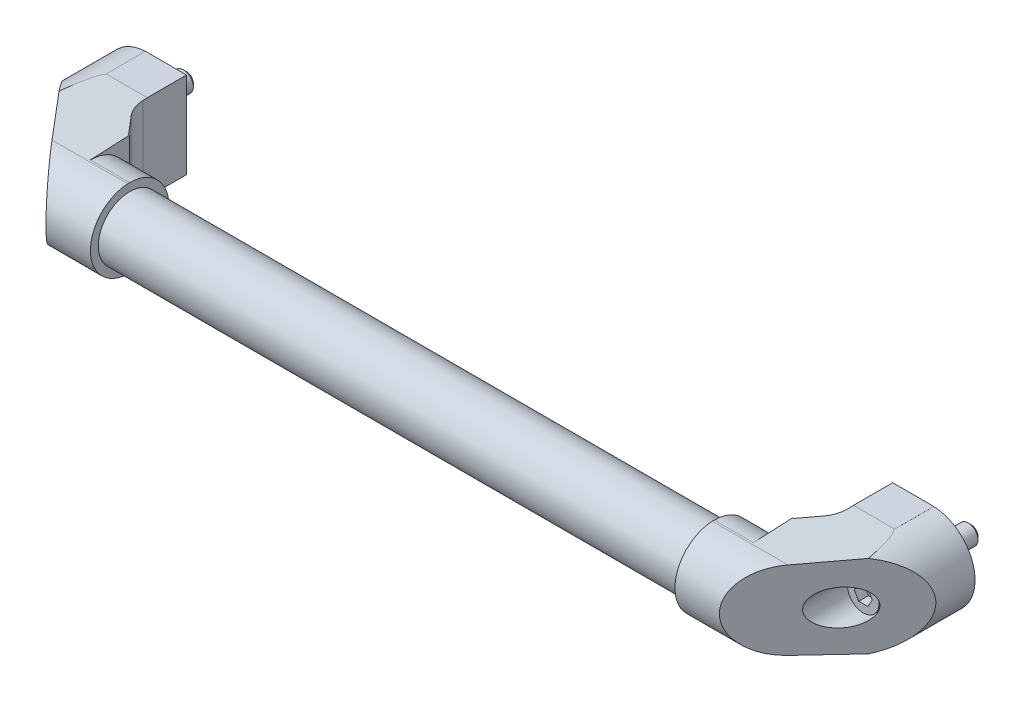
ISO-10303-21;
HEADER;
FILE_DESCRIPTION(('STEP AP214'),'2;1');
FILE_NAME('part.step','',(''),(''),'','','');
FILE_SCHEMA(('AUTOMOTIVE_DESIGN { 1 0 10303 214 1 1 1 1 }'));
ENDSEC;
DATA;
#1=APPLICATION_CONTEXT('core data for automotive mechanical design processes');
#2=APPLICATION_PROTOCOL_DEFINITION('international standard','automotive_design',2000,#1);
#3=PRODUCT_CONTEXT('',#1,'mechanical');
#4=PRODUCT('Part','Part','',(#3));
#5=PRODUCT_RELATED_PRODUCT_CATEGORY('part','',(#4));
#6=PRODUCT_DEFINITION_FORMATION('','',#4);
#7=PRODUCT_DEFINITION_CONTEXT('part definition',#1,'design');
#8=PRODUCT_DEFINITION('design','',#6,#7);
#9=PRODUCT_DEFINITION_SHAPE('','',#8);
#10=(LENGTH_UNIT() NAMED_UNIT(*) SI_UNIT(.MILLI.,.METRE.));
#11=(NAMED_UNIT(*) PLANE_ANGLE_UNIT() SI_UNIT($,.RADIAN.));
#12=(NAMED_UNIT(*) SI_UNIT($,.STERADIAN.) SOLID_ANGLE_UNIT());
#13=UNCERTAINTY_MEASURE_WITH_UNIT(LENGTH_MEASURE(1.E-05),#10,'distance_accuracy_value','');
#14=(GEOMETRIC_REPRESENTATION_CONTEXT(3) GLOBAL_UNCERTAINTY_ASSIGNED_CONTEXT((#13)) GLOBAL_UNIT_ASSIGNED_CONTEXT((#10,
#11,#12)) REPRESENTATION_CONTEXT('',''));
#15=CARTESIAN_POINT('',(0.,0.,0.));
#16=DIRECTION('',(0.,0.,1.));
#17=DIRECTION('',(1.,0.,0.));
#18=AXIS2_PLACEMENT_3D('',#15,#16,#17);
#19=CARTESIAN_POINT('',(400.,0.,25.));
#20=DIRECTION('',(0.,0.,1.));
#21=DIRECTION('',(1.,0.,0.));
#22=AXIS2_PLACEMENT_3D('',#19,#20,#21);
#23=PLANE('',#22);
#24=CARTESIAN_POINT('',(400.,0.,25.));
#25=DIRECTION('',(0.,0.,1.));
#26=DIRECTION('',(1.,0.,0.));
#27=AXIS2_PLACEMENT_3D('',#24,#25,#26);
#28=CIRCLE('',#27,9.);
#29=CARTESIAN_POINT('',(409.,0.,25.));
#30=VERTEX_POINT('',#29);
#31=EDGE_CURVE('E428',#30,#30,#28,.T.);
#32=ORIENTED_EDGE('',*,*,#31,.T.);
#33=EDGE_LOOP('',(#32));
#34=FACE_BOUND('',#33,.T.);
#35=CARTESIAN_POINT('',(400.,0.,25.));
#36=DIRECTION('',(0.,0.,1.));
#37=DIRECTION('',(1.,0.,0.));
#38=AXIS2_PLACEMENT_3D('',#35,#36,#37);
#39=CIRCLE('',#38,8.);
#40=CARTESIAN_POINT('',(408.,0.,25.));
#41=VERTEX_POINT('',#40);
#42=EDGE_CURVE('E404',#41,#41,#39,.T.);
#43=ORIENTED_EDGE('',*,*,#42,.F.);
#44=EDGE_LOOP('',(#43));
#45=FACE_BOUND('',#44,.T.);
#46=ADVANCED_FACE('F14',(#34,#45),#23,.T.);
#47=CARTESIAN_POINT('',(0.,0.,25.));
#48=DIRECTION('',(0.,0.,1.));
#49=DIRECTION('',(1.,0.,0.));
#50=AXIS2_PLACEMENT_3D('',#47,#48,#49);
#51=PLANE('',#50);
#52=CARTESIAN_POINT('',(0.,0.,25.));
#53=DIRECTION('',(0.,0.,1.));
#54=DIRECTION('',(1.,0.,0.));
#55=AXIS2_PLACEMENT_3D('',#52,#53,#54);
#56=CIRCLE('',#55,9.);
#57=CARTESIAN_POINT('',(9.,0.,25.));
#58=VERTEX_POINT('',#57);
#59=EDGE_CURVE('E423',#58,#58,#56,.T.);
#60=ORIENTED_EDGE('',*,*,#59,.T.);
#61=EDGE_LOOP('',(#60));
#62=FACE_BOUND('',#61,.T.);
#63=CARTESIAN_POINT('',(0.,0.,25.));
#64=DIRECTION('',(0.,0.,1.));
#65=DIRECTION('',(1.,0.,0.));
#66=AXIS2_PLACEMENT_3D('',#63,#64,#65);
#67=CIRCLE('',#66,8.);
#68=CARTESIAN_POINT('',(8.,0.,25.));
#69=VERTEX_POINT('',#68);
#70=EDGE_CURVE('E417',#69,#69,#67,.T.);
#71=ORIENTED_EDGE('',*,*,#70,.F.);
#72=EDGE_LOOP('',(#71));
#73=FACE_BOUND('',#72,.T.);
#74=ADVANCED_FACE('F808',(#62,#73),#51,.T.);
#75=CARTESIAN_POINT('',(422.,-19.9756503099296,60.9866076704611));
#76=DIRECTION('',(0.,0.998782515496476,-0.0493303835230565));
#77=DIRECTION('',(0.,0.0493303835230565,0.998782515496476));
#78=AXIS2_PLACEMENT_3D('',#75,#76,#77);
#79=PLANE('',#78);
#80=CARTESIAN_POINT('',(400.,0.,465.429647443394));
#81=DIRECTION('',(0.,0.998782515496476,-0.0493303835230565));
#82=DIRECTION('',(0.,-0.0493303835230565,-0.998782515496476));
#83=AXIS2_PLACEMENT_3D('',#80,#81,#82);
#84=ELLIPSE('',#83,445.972612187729,22.);
#85=CARTESIAN_POINT('',(406.307780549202,-21.0763351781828,38.7012589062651));
#86=VERTEX_POINT('',#85);
#87=CARTESIAN_POINT('',(400.998968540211,-21.9773078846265,20.4594427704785));
#88=VERTEX_POINT('',#87);
#89=EDGE_CURVE('E590',#86,#88,#84,.T.);
#90=ORIENTED_EDGE('',*,*,#89,.F.);
#91=DIRECTION('',(-0.642328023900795,0.0378082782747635,0.765496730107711));
#92=VECTOR('',#91,1.);
#93=CARTESIAN_POINT('',(401.797722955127,-20.8108672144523,44.076136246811));
#94=LINE('',#93,#92);
#95=CARTESIAN_POINT('',(387.608152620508,-19.9756503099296,60.9866076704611));
#96=VERTEX_POINT('',#95);
#97=EDGE_CURVE('E670',#86,#96,#94,.T.);
#98=ORIENTED_EDGE('',*,*,#97,.T.);
#99=DIRECTION('',(-1.,0.,0.));
#100=VECTOR('',#99,1.);
#101=CARTESIAN_POINT('',(422.,-19.9756503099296,60.9866076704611));
#102=LINE('',#101,#100);
#103=CARTESIAN_POINT('',(349.,-19.9756503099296,60.9866076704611));
#104=VERTEX_POINT('',#103);
#105=EDGE_CURVE('E692',#96,#104,#102,.T.);
#106=ORIENTED_EDGE('',*,*,#105,.T.);
#107=DIRECTION('',(0.,-0.0493303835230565,-0.998782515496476));
#108=VECTOR('',#107,1.);
#109=CARTESIAN_POINT('',(349.,-19.9756503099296,60.9866076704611));
#110=LINE('',#109,#108);
#111=CARTESIAN_POINT('',(349.,-20.0243793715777,60.));
#112=VERTEX_POINT('',#111);
#113=EDGE_CURVE('E676',#104,#112,#110,.T.);
#114=ORIENTED_EDGE('',*,*,#113,.T.);
#115=DIRECTION('',(-1.,0.,0.));
#116=VECTOR('',#115,1.);
#117=CARTESIAN_POINT('',(422.,-20.0243793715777,60.));
#118=LINE('',#117,#116);
#119=CARTESIAN_POINT('',(369.,-20.0243793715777,60.));
#120=VERTEX_POINT('',#119);
#121=EDGE_CURVE('E626',#120,#112,#118,.T.);
#122=ORIENTED_EDGE('',*,*,#121,.F.);
#123=DIRECTION('',(0.,0.0493303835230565,0.998782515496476));
#124=VECTOR('',#123,1.);
#125=CARTESIAN_POINT('',(369.,-19.9756503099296,60.9866076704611));
#126=LINE('',#125,#124);
#127=CARTESIAN_POINT('',(369.,-21.0121896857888,40.));
#128=VERTEX_POINT('',#127);
#129=EDGE_CURVE('E621',#128,#120,#126,.T.);
#130=ORIENTED_EDGE('',*,*,#129,.F.);
#131=DIRECTION('',(-1.,0.,0.));
#132=VECTOR('',#131,1.);
#133=CARTESIAN_POINT('',(422.,-21.0121896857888,40.));
#134=LINE('',#133,#132);
#135=CARTESIAN_POINT('',(369.581212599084,-21.0121896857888,40.));
#136=VERTEX_POINT('',#135);
#137=EDGE_CURVE('E652',#136,#128,#134,.T.);
#138=ORIENTED_EDGE('',*,*,#137,.F.);
#139=DIRECTION('',(0.642328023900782,-0.0378082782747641,-0.765496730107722));
#140=VECTOR('',#139,1.);
#141=CARTESIAN_POINT('',(380.864145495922,-21.6763180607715,26.5535241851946));
#142=LINE('',#141,#140);
#143=CARTESIAN_POINT('',(376.510146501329,-21.4200359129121,31.7424181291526));
#144=VERTEX_POINT('',#143);
#145=EDGE_CURVE('E662',#136,#144,#142,.T.);
#146=ORIENTED_EDGE('',*,*,#145,.T.);
#147=CARTESIAN_POINT('',(365.000018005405,-21.8951021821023,22.1238453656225));
#148=DIRECTION('',(0.,0.998782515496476,-0.0493303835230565));
#149=DIRECTION('',(0.,-0.0493303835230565,-0.998782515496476));
#150=AXIS2_PLACEMENT_3D('',#147,#148,#149);
#151=ELLIPSE('',#150,15.0182845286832,15.);
#152=CARTESIAN_POINT('',(380.,-21.8962500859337,22.1006039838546));
#153=VERTEX_POINT('',#152);
#154=EDGE_CURVE('E660',#153,#144,#151,.F.);
#155=ORIENTED_EDGE('',*,*,#154,.F.);
#156=DIRECTION('',(0.,0.0493303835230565,0.998782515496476));
#157=VECTOR('',#156,1.);
#158=CARTESIAN_POINT('',(380.,-19.9756503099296,60.9866076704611));
#159=LINE('',#158,#157);
#160=CARTESIAN_POINT('',(380.,-22.,20.));
#161=VERTEX_POINT('',#160);
#162=EDGE_CURVE('E658',#161,#153,#159,.T.);
#163=ORIENTED_EDGE('',*,*,#162,.F.);
#164=DIRECTION('',(-1.,0.,0.));
#165=VECTOR('',#164,1.);
#166=CARTESIAN_POINT('',(422.,-22.,20.));
#167=LINE('',#166,#165);
#168=CARTESIAN_POINT('',(400.998968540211,-22.,20.));
#169=VERTEX_POINT('',#168);
#170=EDGE_CURVE('E690',#169,#161,#167,.T.);
#171=ORIENTED_EDGE('',*,*,#170,.F.);
#172=DIRECTION('',(0.,-0.0493303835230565,-0.998782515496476));
#173=VECTOR('',#172,1.);
#174=CARTESIAN_POINT('',(400.998968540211,-19.9756503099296,60.9866076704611));
#175=LINE('',#174,#173);
#176=EDGE_CURVE('E595',#88,#169,#175,.T.);
#177=ORIENTED_EDGE('',*,*,#176,.F.);
#178=EDGE_LOOP('',(#90,#98,#106,#114,#122,#130,#138,#146,#155,#163,#171,#177));
#179=FACE_BOUND('',#178,.T.);
#180=ADVANCED_FACE('F16',(#179),#79,.F.);
#181=CARTESIAN_POINT('',(422.,-22.,0.));
#182=DIRECTION('',(0.,0.,1.));
#183=DIRECTION('',(1.,0.,0.));
#184=AXIS2_PLACEMENT_3D('',#181,#182,#183);
#185=PLANE('',#184);
#186=CARTESIAN_POINT('',(400.,0.,0.));
#187=DIRECTION('',(0.,0.,1.));
#188=DIRECTION('',(1.,0.,0.));
#189=AXIS2_PLACEMENT_3D('',#186,#187,#188);
#190=CIRCLE('',#189,4.99999999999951);
#191=CARTESIAN_POINT('',(405.,0.,0.));
#192=VERTEX_POINT('',#191);
#193=EDGE_CURVE('E704',#192,#192,#190,.F.);
#194=ORIENTED_EDGE('',*,*,#193,.F.);
#195=EDGE_LOOP('',(#194));
#196=FACE_BOUND('',#195,.T.);
#197=DIRECTION('',(-1.,0.,0.));
#198=VECTOR('',#197,1.);
#199=CARTESIAN_POINT('',(422.,22.,0.));
#200=LINE('',#199,#198);
#201=CARTESIAN_POINT('',(400.99896854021,22.,0.));
#202=VERTEX_POINT('',#201);
#203=CARTESIAN_POINT('',(380.,22.,0.));
#204=VERTEX_POINT('',#203);
#205=EDGE_CURVE('E686',#202,#204,#200,.T.);
#206=ORIENTED_EDGE('',*,*,#205,.F.);
#207=DIRECTION('',(0.,1.,0.));
#208=VECTOR('',#207,1.);
#209=CARTESIAN_POINT('',(400.99896854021,21.9773078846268,0.));
#210=LINE('',#209,#208);
#211=CARTESIAN_POINT('',(400.99896854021,21.9773078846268,0.));
#212=VERTEX_POINT('',#211);
#213=EDGE_CURVE('E576',#212,#202,#210,.T.);
#214=ORIENTED_EDGE('',*,*,#213,.F.);
#215=CARTESIAN_POINT('',(400.,0.,0.));
#216=DIRECTION('',(0.,0.,-1.));
#217=DIRECTION('',(-1.,0.,0.));
#218=AXIS2_PLACEMENT_3D('',#215,#216,#217);
#219=CIRCLE('',#218,22.);
#220=CARTESIAN_POINT('',(400.998968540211,-21.9773078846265,0.));
#221=VERTEX_POINT('',#220);
#222=EDGE_CURVE('E578',#212,#221,#219,.T.);
#223=ORIENTED_EDGE('',*,*,#222,.T.);
#224=DIRECTION('',(0.,-1.,0.));
#225=VECTOR('',#224,1.);
#226=CARTESIAN_POINT('',(400.998968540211,-21.9773078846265,0.));
#227=LINE('',#226,#225);
#228=CARTESIAN_POINT('',(400.998968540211,-22.,0.));
#229=VERTEX_POINT('',#228);
#230=EDGE_CURVE('E580',#221,#229,#227,.T.);
#231=ORIENTED_EDGE('',*,*,#230,.T.);
#232=DIRECTION('',(-1.,0.,0.));
#233=VECTOR('',#232,1.);
#234=CARTESIAN_POINT('',(422.,-22.,0.));
#235=LINE('',#234,#233);
#236=CARTESIAN_POINT('',(380.,-22.,0.));
#237=VERTEX_POINT('',#236);
#238=EDGE_CURVE('E688',#229,#237,#235,.T.);
#239=ORIENTED_EDGE('',*,*,#238,.T.);
#240=DIRECTION('',(0.,-1.,0.));
#241=VECTOR('',#240,1.);
#242=CARTESIAN_POINT('',(380.,22.,0.));
#243=LINE('',#242,#241);
#244=EDGE_CURVE('E638',#204,#237,#243,.T.);
#245=ORIENTED_EDGE('',*,*,#244,.F.);
#246=EDGE_LOOP('',(#206,#214,#223,#231,#239,#245));
#247=FACE_BOUND('',#246,.T.);
#248=ADVANCED_FACE('F732',(#196,#247),#185,.F.);
#249=CARTESIAN_POINT('',(422.,-22.,0.));
#250=DIRECTION('',(0.,-1.,0.));
#251=DIRECTION('',(1.,0.,0.));
#252=AXIS2_PLACEMENT_3D('',#249,#250,#251);
#253=PLANE('',#252);
#254=ORIENTED_EDGE('',*,*,#238,.F.);
#255=DIRECTION('',(0.,0.,1.));
#256=VECTOR('',#255,1.);
#257=CARTESIAN_POINT('',(400.998968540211,-22.,0.));
#258=LINE('',#257,#256);
#259=EDGE_CURVE('E9',#229,#169,#258,.T.);
#260=ORIENTED_EDGE('',*,*,#259,.T.);
#261=ORIENTED_EDGE('',*,*,#170,.T.);
#262=DIRECTION('',(0.,0.,-1.));
#263=VECTOR('',#262,1.);
#264=CARTESIAN_POINT('',(380.,-22.,0.));
#265=LINE('',#264,#263);
#266=EDGE_CURVE('E655',#161,#237,#265,.T.);
#267=ORIENTED_EDGE('',*,*,#266,.T.);
#268=EDGE_LOOP('',(#254,#260,#261,#267));
#269=FACE_BOUND('',#268,.T.);
#270=ADVANCED_FACE('F737',(#269),#253,.T.);
#271=CARTESIAN_POINT('',(422.,-22.,20.));
#272=DIRECTION('',(-0.766044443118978,0.,-0.64278760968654));
#273=DIRECTION('',(-0.64278760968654,0.,0.766044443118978));
#274=AXIS2_PLACEMENT_3D('',#271,#272,#273);
#275=PLANE('',#274);
#276=CARTESIAN_POINT('',(400.,0.,46.2185790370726));
#277=DIRECTION('',(-0.766044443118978,0.,-0.64278760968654));
#278=DIRECTION('',(-0.64278760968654,0.,0.766044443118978));
#279=AXIS2_PLACEMENT_3D('',#276,#277,#278);
#280=ELLIPSE('',#279,14.0015144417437,9.);
#281=CARTESIAN_POINT('',(391.,0.,56.9443613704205));
#282=VERTEX_POINT('',#281);
#283=EDGE_CURVE('E628',#282,#282,#280,.T.);
#284=ORIENTED_EDGE('',*,*,#283,.T.);
#285=EDGE_LOOP('',(#284));
#286=FACE_BOUND('',#285,.T.);
#287=ORIENTED_EDGE('',*,*,#97,.F.);
#288=CARTESIAN_POINT('',(400.,0.,46.2185790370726));
#289=DIRECTION('',(-0.766044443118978,0.,-0.64278760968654));
#290=DIRECTION('',(0.64278760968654,0.,-0.766044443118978));
#291=AXIS2_PLACEMENT_3D('',#288,#289,#290);
#292=ELLIPSE('',#291,34.225924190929,22.);
#293=CARTESIAN_POINT('',(406.307780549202,21.076335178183,38.7012589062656));
#294=VERTEX_POINT('',#293);
#295=EDGE_CURVE('E713',#294,#86,#292,.T.);
#296=ORIENTED_EDGE('',*,*,#295,.F.);
#297=DIRECTION('',(0.642328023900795,0.0378082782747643,-0.765496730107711));
#298=VECTOR('',#297,1.);
#299=CARTESIAN_POINT('',(422.,22.,20.));
#300=LINE('',#299,#298);
#301=CARTESIAN_POINT('',(387.608152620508,19.9756503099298,60.9866076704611));
#302=VERTEX_POINT('',#301);
#303=EDGE_CURVE('E665',#302,#294,#300,.T.);
#304=ORIENTED_EDGE('',*,*,#303,.F.);
#305=CARTESIAN_POINT('',(388.436014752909,0.,60.));
#306=DIRECTION('',(-0.766044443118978,0.,-0.64278760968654));
#307=DIRECTION('',(-0.64278760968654,0.,0.766044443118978));
#308=AXIS2_PLACEMENT_3D('',#305,#306,#307);
#309=ELLIPSE('',#308,26.1081457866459,20.);
#310=EDGE_CURVE('E668',#96,#302,#309,.T.);
#311=ORIENTED_EDGE('',*,*,#310,.F.);
#312=EDGE_LOOP('',(#287,#296,#304,#311));
#313=FACE_BOUND('',#312,.T.);
#314=ADVANCED_FACE('F787',(#286,#313),#275,.F.);
#315=CARTESIAN_POINT('',(349.,0.,60.));
#316=DIRECTION('',(1.,0.,0.));
#317=DIRECTION('',(0.,1.,0.));
#318=AXIS2_PLACEMENT_3D('',#315,#316,#317);
#319=PLANE('',#318);
#320=CARTESIAN_POINT('',(349.,0.,60.));
#321=DIRECTION('',(1.,0.,0.));
#322=DIRECTION('',(0.,1.,0.));
#323=AXIS2_PLACEMENT_3D('',#320,#321,#322);
#324=CIRCLE('',#323,16.);
#325=CARTESIAN_POINT('',(349.,16.,60.));
#326=VERTEX_POINT('',#325);
#327=EDGE_CURVE('E672',#326,#326,#324,.T.);
#328=ORIENTED_EDGE('',*,*,#327,.T.);
#329=EDGE_LOOP('',(#328));
#330=FACE_BOUND('',#329,.T.);
#331=DIRECTION('',(0.,-1.,0.));
#332=VECTOR('',#331,1.);
#333=CARTESIAN_POINT('',(349.,-20.,60.));
#334=LINE('',#333,#332);
#335=CARTESIAN_POINT('',(349.,-20.,60.));
#336=VERTEX_POINT('',#335);
#337=EDGE_CURVE('E599',#336,#112,#334,.T.);
#338=ORIENTED_EDGE('',*,*,#337,.T.);
#339=ORIENTED_EDGE('',*,*,#113,.F.);
#340=CARTESIAN_POINT('',(349.,0.,60.));
#341=DIRECTION('',(1.,0.,0.));
#342=DIRECTION('',(0.,1.,0.));
#343=AXIS2_PLACEMENT_3D('',#340,#341,#342);
#344=CIRCLE('',#343,20.);
#345=CARTESIAN_POINT('',(349.,19.9756503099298,60.9866076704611));
#346=VERTEX_POINT('',#345);
#347=EDGE_CURVE('E673',#346,#104,#344,.T.);
#348=ORIENTED_EDGE('',*,*,#347,.F.);
#349=DIRECTION('',(0.,-0.0493303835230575,0.998782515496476));
#350=VECTOR('',#349,1.);
#351=CARTESIAN_POINT('',(349.,22.,20.));
#352=LINE('',#351,#350);
#353=CARTESIAN_POINT('',(349.,20.0243793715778,60.));
#354=VERTEX_POINT('',#353);
#355=EDGE_CURVE('E679',#354,#346,#352,.T.);
#356=ORIENTED_EDGE('',*,*,#355,.F.);
#357=DIRECTION('',(0.,1.,0.));
#358=VECTOR('',#357,1.);
#359=CARTESIAN_POINT('',(349.,20.,60.));
#360=LINE('',#359,#358);
#361=CARTESIAN_POINT('',(349.,20.,60.));
#362=VERTEX_POINT('',#361);
#363=EDGE_CURVE('E602',#362,#354,#360,.T.);
#364=ORIENTED_EDGE('',*,*,#363,.F.);
#365=CARTESIAN_POINT('',(349.,0.,60.));
#366=DIRECTION('',(-1.,0.,0.));
#367=DIRECTION('',(0.,-1.,0.));
#368=AXIS2_PLACEMENT_3D('',#365,#366,#367);
#369=CIRCLE('',#368,20.);
#370=EDGE_CURVE('E597',#362,#336,#369,.T.);
#371=ORIENTED_EDGE('',*,*,#370,.T.);
#372=EDGE_LOOP('',(#338,#339,#348,#356,#364,#371));
#373=FACE_BOUND('',#372,.T.);
#374=ADVANCED_FACE('F777',(#330,#373),#319,.F.);
#375=CARTESIAN_POINT('',(349.,22.,40.));
#376=DIRECTION('',(0.,0.,-1.));
#377=DIRECTION('',(-1.,0.,0.));
#378=AXIS2_PLACEMENT_3D('',#375,#376,#377);
#379=PLANE('',#378);
#380=ORIENTED_EDGE('',*,*,#137,.T.);
#381=DIRECTION('',(0.,1.,0.));
#382=VECTOR('',#381,1.);
#383=CARTESIAN_POINT('',(369.,22.,40.));
#384=LINE('',#383,#382);
#385=CARTESIAN_POINT('',(369.,0.,40.));
#386=VERTEX_POINT('',#385);
#387=EDGE_CURVE('E712',#128,#386,#384,.T.);
#388=ORIENTED_EDGE('',*,*,#387,.T.);
#389=CARTESIAN_POINT('',(369.,21.012189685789,40.));
#390=VERTEX_POINT('',#389);
#391=EDGE_CURVE('E707',#386,#390,#384,.T.);
#392=ORIENTED_EDGE('',*,*,#391,.T.);
#393=DIRECTION('',(1.,0.,0.));
#394=VECTOR('',#393,1.);
#395=CARTESIAN_POINT('',(422.,21.012189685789,40.));
#396=LINE('',#395,#394);
#397=CARTESIAN_POINT('',(369.581212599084,21.012189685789,40.));
#398=VERTEX_POINT('',#397);
#399=EDGE_CURVE('E650',#390,#398,#396,.T.);
#400=ORIENTED_EDGE('',*,*,#399,.T.);
#401=DIRECTION('',(0.,-1.,0.));
#402=VECTOR('',#401,1.);
#403=CARTESIAN_POINT('',(369.581212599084,22.,40.));
#404=LINE('',#403,#402);
#405=EDGE_CURVE('E647',#398,#136,#404,.T.);
#406=ORIENTED_EDGE('',*,*,#405,.T.);
#407=EDGE_LOOP('',(#380,#388,#392,#400,#406));
#408=FACE_BOUND('',#407,.T.);
#409=ADVANCED_FACE('F755',(#408),#379,.T.);
#410=CARTESIAN_POINT('',(422.,22.,0.));
#411=DIRECTION('',(0.,-1.,0.));
#412=DIRECTION('',(1.,0.,0.));
#413=AXIS2_PLACEMENT_3D('',#410,#411,#412);
#414=PLANE('',#413);
#415=DIRECTION('',(-1.,0.,0.));
#416=VECTOR('',#415,1.);
#417=CARTESIAN_POINT('',(422.,22.,20.));
#418=LINE('',#417,#416);
#419=CARTESIAN_POINT('',(400.99896854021,22.,20.));
#420=VERTEX_POINT('',#419);
#421=CARTESIAN_POINT('',(380.,22.,20.));
#422=VERTEX_POINT('',#421);
#423=EDGE_CURVE('E684',#420,#422,#418,.T.);
#424=ORIENTED_EDGE('',*,*,#423,.F.);
#425=DIRECTION('',(0.,0.,-1.));
#426=VECTOR('',#425,1.);
#427=CARTESIAN_POINT('',(400.99896854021,22.,0.));
#428=LINE('',#427,#426);
#429=EDGE_CURVE('E592',#420,#202,#428,.T.);
#430=ORIENTED_EDGE('',*,*,#429,.T.);
#431=ORIENTED_EDGE('',*,*,#205,.T.);
#432=DIRECTION('',(0.,0.,-1.));
#433=VECTOR('',#432,1.);
#434=CARTESIAN_POINT('',(380.,22.,22.1006039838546));
#435=LINE('',#434,#433);
#436=EDGE_CURVE('E635',#422,#204,#435,.T.);
#437=ORIENTED_EDGE('',*,*,#436,.F.);
#438=EDGE_LOOP('',(#424,#430,#431,#437));
#439=FACE_BOUND('',#438,.T.);
#440=ADVANCED_FACE('F724',(#439),#414,.F.);
#441=CARTESIAN_POINT('',(422.,22.,20.));
#442=DIRECTION('',(0.,-0.998782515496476,-0.0493303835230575));
#443=DIRECTION('',(0.,0.0493303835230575,-0.998782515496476));
#444=AXIS2_PLACEMENT_3D('',#441,#442,#443);
#445=PLANE('',#444);
#446=CARTESIAN_POINT('',(400.,0.,465.429647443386));
#447=DIRECTION('',(0.,-0.998782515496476,-0.0493303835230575));
#448=DIRECTION('',(0.,0.0493303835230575,-0.998782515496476));
#449=AXIS2_PLACEMENT_3D('',#446,#447,#448);
#450=ELLIPSE('',#449,445.97261218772,22.);
#451=CARTESIAN_POINT('',(400.99896854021,21.9773078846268,20.4594427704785));
#452=VERTEX_POINT('',#451);
#453=EDGE_CURVE('E588',#452,#294,#450,.T.);
#454=ORIENTED_EDGE('',*,*,#453,.F.);
#455=DIRECTION('',(0.,0.0493303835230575,-0.998782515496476));
#456=VECTOR('',#455,1.);
#457=CARTESIAN_POINT('',(400.99896854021,22.,20.));
#458=LINE('',#457,#456);
#459=EDGE_CURVE('E22',#452,#420,#458,.T.);
#460=ORIENTED_EDGE('',*,*,#459,.T.);
#461=ORIENTED_EDGE('',*,*,#423,.T.);
#462=DIRECTION('',(0.,0.0493303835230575,-0.998782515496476));
#463=VECTOR('',#462,1.);
#464=CARTESIAN_POINT('',(380.,22.,20.));
#465=LINE('',#464,#463);
#466=CARTESIAN_POINT('',(380.,21.8962500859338,22.1006039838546));
#467=VERTEX_POINT('',#466);
#468=EDGE_CURVE('E694',#467,#422,#465,.T.);
#469=ORIENTED_EDGE('',*,*,#468,.F.);
#470=CARTESIAN_POINT('',(365.000018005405,21.8951021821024,22.1238453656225));
#471=DIRECTION('',(0.,-0.998782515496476,-0.0493303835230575));
#472=DIRECTION('',(0.,-0.0493303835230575,0.998782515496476));
#473=AXIS2_PLACEMENT_3D('',#470,#471,#472);
#474=ELLIPSE('',#473,15.0182845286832,15.);
#475=CARTESIAN_POINT('',(376.510146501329,21.4200359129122,31.7424181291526));
#476=VERTEX_POINT('',#475);
#477=EDGE_CURVE('E699',#476,#467,#474,.F.);
#478=ORIENTED_EDGE('',*,*,#477,.F.);
#479=DIRECTION('',(-0.642328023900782,-0.0378082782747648,0.765496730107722));
#480=VECTOR('',#479,1.);
#481=CARTESIAN_POINT('',(401.066422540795,22.8654508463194,2.47738793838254));
#482=LINE('',#481,#480);
#483=EDGE_CURVE('E701',#476,#398,#482,.T.);
#484=ORIENTED_EDGE('',*,*,#483,.T.);
#485=ORIENTED_EDGE('',*,*,#399,.F.);
#486=DIRECTION('',(0.,0.0493303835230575,-0.998782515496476));
#487=VECTOR('',#486,1.);
#488=CARTESIAN_POINT('',(369.,22.,20.));
#489=LINE('',#488,#487);
#490=CARTESIAN_POINT('',(369.,20.0243793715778,60.));
#491=VERTEX_POINT('',#490);
#492=EDGE_CURVE('E619',#491,#390,#489,.T.);
#493=ORIENTED_EDGE('',*,*,#492,.F.);
#494=DIRECTION('',(-1.,0.,0.));
#495=VECTOR('',#494,1.);
#496=CARTESIAN_POINT('',(422.,20.0243793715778,60.));
#497=LINE('',#496,#495);
#498=EDGE_CURVE('E623',#491,#354,#497,.T.);
#499=ORIENTED_EDGE('',*,*,#498,.T.);
#500=ORIENTED_EDGE('',*,*,#355,.T.);
#501=DIRECTION('',(-1.,0.,0.));
#502=VECTOR('',#501,1.);
#503=CARTESIAN_POINT('',(422.,19.9756503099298,60.9866076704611));
#504=LINE('',#503,#502);
#505=EDGE_CURVE('E681',#302,#346,#504,.T.);
#506=ORIENTED_EDGE('',*,*,#505,.F.);
#507=ORIENTED_EDGE('',*,*,#303,.T.);
#508=EDGE_LOOP('',(#454,#460,#461,#469,#478,#484,#485,#493,#499,#500,#506,#507));
#509=FACE_BOUND('',#508,.T.);
#510=ADVANCED_FACE('F718',(#509),#445,.F.);
#511=CARTESIAN_POINT('',(422.,0.,60.));
#512=DIRECTION('',(-1.,0.,0.));
#513=DIRECTION('',(0.,-1.,0.));
#514=AXIS2_PLACEMENT_3D('',#511,#512,#513);
#515=CYLINDRICAL_SURFACE('',#514,20.);
#516=ORIENTED_EDGE('',*,*,#310,.T.);
#517=ORIENTED_EDGE('',*,*,#505,.T.);
#518=ORIENTED_EDGE('',*,*,#347,.T.);
#519=ORIENTED_EDGE('',*,*,#105,.F.);
#520=EDGE_LOOP('',(#516,#517,#518,#519));
#521=FACE_BOUND('',#520,.T.);
#522=ADVANCED_FACE('F781',(#521),#515,.T.);
#523=CARTESIAN_POINT('',(391.182067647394,0.,60.));
#524=DIRECTION('',(1.,0.,0.));
#525=DIRECTION('',(0.,1.,0.));
#526=AXIS2_PLACEMENT_3D('',#523,#524,#525);
#527=CYLINDRICAL_SURFACE('',#526,16.);
#528=ORIENTED_EDGE('',*,*,#327,.F.);
#529=EDGE_LOOP('',(#528));
#530=FACE_BOUND('',#529,.T.);
#531=CARTESIAN_POINT('',(51.,0.,60.));
#532=DIRECTION('',(1.,0.,0.));
#533=DIRECTION('',(0.,1.,0.));
#534=AXIS2_PLACEMENT_3D('',#531,#532,#533);
#535=CIRCLE('',#534,16.);
#536=CARTESIAN_POINT('',(51.,16.,60.));
#537=VERTEX_POINT('',#536);
#538=EDGE_CURVE('E527',#537,#537,#535,.T.);
#539=ORIENTED_EDGE('',*,*,#538,.T.);
#540=EDGE_LOOP('',(#539));
#541=FACE_BOUND('',#540,.T.);
#542=ADVANCED_FACE('F1251',(#530,#541),#527,.T.);
#543=CARTESIAN_POINT('',(376.510146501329,22.,31.7424181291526));
#544=DIRECTION('',(0.766044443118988,0.,0.642787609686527));
#545=DIRECTION('',(0.642787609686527,0.,-0.766044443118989));
#546=AXIS2_PLACEMENT_3D('',#543,#544,#545);
#547=PLANE('',#546);
#548=ORIENTED_EDGE('',*,*,#405,.F.);
#549=ORIENTED_EDGE('',*,*,#483,.F.);
#550=DIRECTION('',(0.,-1.,0.));
#551=VECTOR('',#550,1.);
#552=CARTESIAN_POINT('',(376.510146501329,22.,31.7424181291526));
#553=LINE('',#552,#551);
#554=EDGE_CURVE('E644',#476,#144,#553,.T.);
#555=ORIENTED_EDGE('',*,*,#554,.T.);
#556=ORIENTED_EDGE('',*,*,#145,.F.);
#557=EDGE_LOOP('',(#548,#549,#555,#556));
#558=FACE_BOUND('',#557,.T.);
#559=ADVANCED_FACE('F751',(#558),#547,.F.);
#560=CARTESIAN_POINT('',(365.000018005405,22.,22.1238453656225));
#561=DIRECTION('',(0.,-1.,0.));
#562=DIRECTION('',(1.,0.,0.));
#563=AXIS2_PLACEMENT_3D('',#560,#561,#562);
#564=CYLINDRICAL_SURFACE('',#563,15.);
#565=ORIENTED_EDGE('',*,*,#154,.T.);
#566=ORIENTED_EDGE('',*,*,#554,.F.);
#567=ORIENTED_EDGE('',*,*,#477,.T.);
#568=DIRECTION('',(0.,-1.,0.));
#569=VECTOR('',#568,1.);
#570=CARTESIAN_POINT('',(380.,22.,22.1006039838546));
#571=LINE('',#570,#569);
#572=EDGE_CURVE('E641',#467,#153,#571,.T.);
#573=ORIENTED_EDGE('',*,*,#572,.T.);
#574=EDGE_LOOP('',(#565,#566,#567,#573));
#575=FACE_BOUND('',#574,.T.);
#576=ADVANCED_FACE('F747',(#575),#564,.F.);
#577=CARTESIAN_POINT('',(380.,22.,22.1006039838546));
#578=DIRECTION('',(-1.,0.,0.));
#579=DIRECTION('',(0.,-1.,0.));
#580=AXIS2_PLACEMENT_3D('',#577,#578,#579);
#581=PLANE('',#580);
#582=ORIENTED_EDGE('',*,*,#162,.T.);
#583=ORIENTED_EDGE('',*,*,#572,.F.);
#584=ORIENTED_EDGE('',*,*,#468,.T.);
#585=ORIENTED_EDGE('',*,*,#436,.T.);
#586=ORIENTED_EDGE('',*,*,#244,.T.);
#587=ORIENTED_EDGE('',*,*,#266,.F.);
#588=EDGE_LOOP('',(#582,#583,#584,#585,#586,#587));
#589=FACE_BOUND('',#588,.T.);
#590=ADVANCED_FACE('F728',(#589),#581,.T.);
#591=CARTESIAN_POINT('',(400.,0.,31.7424181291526));
#592=DIRECTION('',(0.,0.,1.));
#593=DIRECTION('',(0.,-1.,0.));
#594=AXIS2_PLACEMENT_3D('',#591,#592,#593);
#595=CYLINDRICAL_SURFACE('',#594,4.99999999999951);
#596=CARTESIAN_POINT('',(400.,0.,-18.5));
#597=DIRECTION('',(0.,0.,1.));
#598=DIRECTION('',(0.,-1.,0.));
#599=AXIS2_PLACEMENT_3D('',#596,#597,#598);
#600=CIRCLE('',#599,4.99999999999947);
#601=CARTESIAN_POINT('',(400.,-4.99999999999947,-18.5));
#602=VERTEX_POINT('',#601);
#603=EDGE_CURVE('E629',#602,#602,#600,.T.);
#604=ORIENTED_EDGE('',*,*,#603,.T.);
#605=EDGE_LOOP('',(#604));
#606=FACE_BOUND('',#605,.T.);
#607=ORIENTED_EDGE('',*,*,#193,.T.);
#608=EDGE_LOOP('',(#607));
#609=FACE_BOUND('',#608,.T.);
#610=ADVANCED_FACE('F1204',(#606,#609),#595,.T.);
#611=CARTESIAN_POINT('',(400.,0.,-20.));
#612=DIRECTION('',(0.,0.,1.));
#613=DIRECTION('',(0.,-1.,0.));
#614=AXIS2_PLACEMENT_3D('',#611,#612,#613);
#615=PLANE('',#614);
#616=CARTESIAN_POINT('',(400.,0.,-20.));
#617=DIRECTION('',(0.,0.,1.));
#618=DIRECTION('',(0.,-1.,0.));
#619=AXIS2_PLACEMENT_3D('',#616,#617,#618);
#620=CIRCLE('',#619,3.49999999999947);
#621=CARTESIAN_POINT('',(400.,-3.49999999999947,-20.));
#622=VERTEX_POINT('',#621);
#623=EDGE_CURVE('E632',#622,#622,#620,.T.);
#624=ORIENTED_EDGE('',*,*,#623,.F.);
#625=EDGE_LOOP('',(#624));
#626=FACE_BOUND('',#625,.T.);
#627=ADVANCED_FACE('F1209',(#626),#615,.F.);
#628=CARTESIAN_POINT('',(400.,0.,-20.));
#629=DIRECTION('',(0.,0.,1.));
#630=DIRECTION('',(0.,-1.,0.));
#631=AXIS2_PLACEMENT_3D('',#628,#629,#630);
#632=CONICAL_SURFACE('',#631,3.49999999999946,0.785398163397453);
#633=ORIENTED_EDGE('',*,*,#603,.F.);
#634=EDGE_LOOP('',(#633));
#635=FACE_BOUND('',#634,.T.);
#636=ORIENTED_EDGE('',*,*,#623,.T.);
#637=EDGE_LOOP('',(#636));
#638=FACE_BOUND('',#637,.T.);
#639=ADVANCED_FACE('F1156',(#635,#638),#632,.T.);
#640=CARTESIAN_POINT('',(400.,0.,30.));
#641=DIRECTION('',(0.,0.,1.));
#642=DIRECTION('',(1.,0.,0.));
#643=AXIS2_PLACEMENT_3D('',#640,#641,#642);
#644=CYLINDRICAL_SURFACE('',#643,9.);
#645=ORIENTED_EDGE('',*,*,#283,.F.);
#646=EDGE_LOOP('',(#645));
#647=FACE_BOUND('',#646,.T.);
#648=ORIENTED_EDGE('',*,*,#31,.F.);
#649=EDGE_LOOP('',(#648));
#650=FACE_BOUND('',#649,.T.);
#651=ADVANCED_FACE('F1150',(#647,#650),#644,.F.);
#652=CARTESIAN_POINT('',(369.,-20.,60.));
#653=DIRECTION('',(0.,0.,-1.));
#654=DIRECTION('',(-1.,0.,0.));
#655=AXIS2_PLACEMENT_3D('',#652,#653,#654);
#656=PLANE('',#655);
#657=ORIENTED_EDGE('',*,*,#121,.T.);
#658=ORIENTED_EDGE('',*,*,#337,.F.);
#659=DIRECTION('',(-1.,0.,0.));
#660=VECTOR('',#659,1.);
#661=CARTESIAN_POINT('',(369.,-20.,60.));
#662=LINE('',#661,#660);
#663=CARTESIAN_POINT('',(369.,-20.,60.));
#664=VERTEX_POINT('',#663);
#665=EDGE_CURVE('E616',#664,#336,#662,.T.);
#666=ORIENTED_EDGE('',*,*,#665,.F.);
#667=DIRECTION('',(0.,-1.,0.));
#668=VECTOR('',#667,1.);
#669=CARTESIAN_POINT('',(369.,-20.,60.));
#670=LINE('',#669,#668);
#671=EDGE_CURVE('E608',#664,#120,#670,.T.);
#672=ORIENTED_EDGE('',*,*,#671,.T.);
#673=EDGE_LOOP('',(#657,#658,#666,#672));
#674=FACE_BOUND('',#673,.T.);
#675=ADVANCED_FACE('F1155',(#674),#656,.T.);
#676=CARTESIAN_POINT('',(369.,20.,60.));
#677=DIRECTION('',(0.,0.,1.));
#678=DIRECTION('',(1.,0.,0.));
#679=AXIS2_PLACEMENT_3D('',#676,#677,#678);
#680=PLANE('',#679);
#681=DIRECTION('',(0.,1.,0.));
#682=VECTOR('',#681,1.);
#683=CARTESIAN_POINT('',(369.,20.,60.));
#684=LINE('',#683,#682);
#685=CARTESIAN_POINT('',(369.,20.,60.));
#686=VERTEX_POINT('',#685);
#687=EDGE_CURVE('E611',#686,#491,#684,.T.);
#688=ORIENTED_EDGE('',*,*,#687,.F.);
#689=DIRECTION('',(-1.,0.,0.));
#690=VECTOR('',#689,1.);
#691=CARTESIAN_POINT('',(369.,20.,60.));
#692=LINE('',#691,#690);
#693=EDGE_CURVE('E614',#686,#362,#692,.T.);
#694=ORIENTED_EDGE('',*,*,#693,.T.);
#695=ORIENTED_EDGE('',*,*,#363,.T.);
#696=ORIENTED_EDGE('',*,*,#498,.F.);
#697=EDGE_LOOP('',(#688,#694,#695,#696));
#698=FACE_BOUND('',#697,.T.);
#699=ADVANCED_FACE('F772',(#698),#680,.F.);
#700=CARTESIAN_POINT('',(369.,0.,60.));
#701=DIRECTION('',(-1.,0.,0.));
#702=DIRECTION('',(0.,-1.,0.));
#703=AXIS2_PLACEMENT_3D('',#700,#701,#702);
#704=CYLINDRICAL_SURFACE('',#703,20.);
#705=CARTESIAN_POINT('',(369.,0.,60.));
#706=DIRECTION('',(-1.,0.,0.));
#707=DIRECTION('',(0.,-1.,0.));
#708=AXIS2_PLACEMENT_3D('',#705,#706,#707);
#709=CIRCLE('',#708,20.);
#710=EDGE_CURVE('E605',#686,#386,#709,.T.);
#711=ORIENTED_EDGE('',*,*,#710,.T.);
#712=EDGE_CURVE('E604',#386,#664,#709,.T.);
#713=ORIENTED_EDGE('',*,*,#712,.T.);
#714=ORIENTED_EDGE('',*,*,#665,.T.);
#715=ORIENTED_EDGE('',*,*,#370,.F.);
#716=ORIENTED_EDGE('',*,*,#693,.F.);
#717=EDGE_LOOP('',(#711,#713,#714,#715,#716));
#718=FACE_BOUND('',#717,.T.);
#719=ADVANCED_FACE('F768',(#718),#704,.T.);
#720=CARTESIAN_POINT('',(369.,0.,60.));
#721=DIRECTION('',(-1.,0.,0.));
#722=DIRECTION('',(0.,-1.,0.));
#723=AXIS2_PLACEMENT_3D('',#720,#721,#722);
#724=PLANE('',#723);
#725=ORIENTED_EDGE('',*,*,#129,.T.);
#726=ORIENTED_EDGE('',*,*,#671,.F.);
#727=ORIENTED_EDGE('',*,*,#712,.F.);
#728=ORIENTED_EDGE('',*,*,#387,.F.);
#729=EDGE_LOOP('',(#725,#726,#727,#728));
#730=FACE_BOUND('',#729,.T.);
#731=ADVANCED_FACE('F764',(#730),#724,.T.);
#732=ORIENTED_EDGE('',*,*,#492,.T.);
#733=ORIENTED_EDGE('',*,*,#391,.F.);
#734=ORIENTED_EDGE('',*,*,#710,.F.);
#735=ORIENTED_EDGE('',*,*,#687,.T.);
#736=EDGE_LOOP('',(#732,#733,#734,#735));
#737=FACE_BOUND('',#736,.T.);
#738=ADVANCED_FACE('F760',(#737),#724,.T.);
#739=CARTESIAN_POINT('',(400.998968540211,-21.9773078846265,80.));
#740=DIRECTION('',(1.,0.,0.));
#741=DIRECTION('',(0.,1.,0.));
#742=AXIS2_PLACEMENT_3D('',#739,#740,#741);
#743=PLANE('',#742);
#744=ORIENTED_EDGE('',*,*,#176,.T.);
#745=ORIENTED_EDGE('',*,*,#259,.F.);
#746=ORIENTED_EDGE('',*,*,#230,.F.);
#747=DIRECTION('',(0.,0.,-1.));
#748=VECTOR('',#747,1.);
#749=CARTESIAN_POINT('',(400.998968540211,-21.9773078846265,80.));
#750=LINE('',#749,#748);
#751=EDGE_CURVE('E583',#88,#221,#750,.T.);
#752=ORIENTED_EDGE('',*,*,#751,.F.);
#753=EDGE_LOOP('',(#744,#745,#746,#752));
#754=FACE_BOUND('',#753,.T.);
#755=ADVANCED_FACE('F792',(#754),#743,.T.);
#756=CARTESIAN_POINT('',(400.99896854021,21.9773078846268,80.));
#757=DIRECTION('',(-1.,0.,0.));
#758=DIRECTION('',(0.,-1.,0.));
#759=AXIS2_PLACEMENT_3D('',#756,#757,#758);
#760=PLANE('',#759);
#761=ORIENTED_EDGE('',*,*,#459,.F.);
#762=DIRECTION('',(0.,0.,-1.));
#763=VECTOR('',#762,1.);
#764=CARTESIAN_POINT('',(400.99896854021,21.9773078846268,80.));
#765=LINE('',#764,#763);
#766=EDGE_CURVE('E586',#452,#212,#765,.T.);
#767=ORIENTED_EDGE('',*,*,#766,.T.);
#768=ORIENTED_EDGE('',*,*,#213,.T.);
#769=ORIENTED_EDGE('',*,*,#429,.F.);
#770=EDGE_LOOP('',(#761,#767,#768,#769));
#771=FACE_BOUND('',#770,.T.);
#772=ADVANCED_FACE('F794',(#771),#760,.F.);
#773=CARTESIAN_POINT('',(400.,0.,80.));
#774=DIRECTION('',(0.,0.,-1.));
#775=DIRECTION('',(-1.,0.,0.));
#776=AXIS2_PLACEMENT_3D('',#773,#774,#775);
#777=CYLINDRICAL_SURFACE('',#776,22.);
#778=ORIENTED_EDGE('',*,*,#295,.T.);
#779=ORIENTED_EDGE('',*,*,#89,.T.);
#780=ORIENTED_EDGE('',*,*,#751,.T.);
#781=ORIENTED_EDGE('',*,*,#222,.F.);
#782=ORIENTED_EDGE('',*,*,#766,.F.);
#783=ORIENTED_EDGE('',*,*,#453,.T.);
#784=EDGE_LOOP('',(#778,#779,#780,#781,#782,#783));
#785=FACE_BOUND('',#784,.T.);
#786=ADVANCED_FACE('F789',(#785),#777,.T.);
#787=CARTESIAN_POINT('',(-22.,-19.9756503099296,60.9866076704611));
#788=DIRECTION('',(0.,0.998782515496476,-0.0493303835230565));
#789=DIRECTION('',(0.,0.0493303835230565,0.998782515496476));
#790=AXIS2_PLACEMENT_3D('',#787,#788,#789);
#791=PLANE('',#790);
#792=CARTESIAN_POINT('',(0.,0.,465.429647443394));
#793=DIRECTION('',(0.,-0.998782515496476,0.0493303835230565));
#794=DIRECTION('',(0.,-0.0493303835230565,-0.998782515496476));
#795=AXIS2_PLACEMENT_3D('',#792,#793,#794);
#796=ELLIPSE('',#795,445.972612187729,22.);
#797=CARTESIAN_POINT('',(-6.30778054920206,-21.0763351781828,38.7012589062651));
#798=VERTEX_POINT('',#797);
#799=CARTESIAN_POINT('',(-0.998968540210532,-21.9773078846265,20.4594427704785));
#800=VERTEX_POINT('',#799);
#801=EDGE_CURVE('E445',#798,#800,#796,.T.);
#802=ORIENTED_EDGE('',*,*,#801,.T.);
#803=DIRECTION('',(0.,-0.0493303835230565,-0.998782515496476));
#804=VECTOR('',#803,1.);
#805=CARTESIAN_POINT('',(-0.998968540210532,-19.9756503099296,60.9866076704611));
#806=LINE('',#805,#804);
#807=CARTESIAN_POINT('',(-0.998968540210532,-22.,20.));
#808=VERTEX_POINT('',#807);
#809=EDGE_CURVE('E450',#800,#808,#806,.T.);
#810=ORIENTED_EDGE('',*,*,#809,.T.);
#811=DIRECTION('',(1.,0.,0.));
#812=VECTOR('',#811,1.);
#813=CARTESIAN_POINT('',(-22.,-22.,20.));
#814=LINE('',#813,#812);
#815=CARTESIAN_POINT('',(20.,-22.,20.));
#816=VERTEX_POINT('',#815);
#817=EDGE_CURVE('E545',#808,#816,#814,.T.);
#818=ORIENTED_EDGE('',*,*,#817,.T.);
#819=DIRECTION('',(0.,0.0493303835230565,0.998782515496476));
#820=VECTOR('',#819,1.);
#821=CARTESIAN_POINT('',(20.,-19.9756503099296,60.9866076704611));
#822=LINE('',#821,#820);
#823=CARTESIAN_POINT('',(20.,-21.8962500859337,22.1006039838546));
#824=VERTEX_POINT('',#823);
#825=EDGE_CURVE('E513',#816,#824,#822,.T.);
#826=ORIENTED_EDGE('',*,*,#825,.T.);
#827=CARTESIAN_POINT('',(34.999981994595,-21.8951021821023,22.1238453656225));
#828=DIRECTION('',(0.,-0.998782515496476,0.0493303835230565));
#829=DIRECTION('',(0.,-0.0493303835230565,-0.998782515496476));
#830=AXIS2_PLACEMENT_3D('',#827,#828,#829);
#831=ELLIPSE('',#830,15.0182845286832,15.);
#832=CARTESIAN_POINT('',(23.489853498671,-21.4200359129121,31.7424181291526));
#833=VERTEX_POINT('',#832);
#834=EDGE_CURVE('E515',#824,#833,#831,.F.);
#835=ORIENTED_EDGE('',*,*,#834,.T.);
#836=DIRECTION('',(-0.642328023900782,-0.0378082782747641,-0.765496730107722));
#837=VECTOR('',#836,1.);
#838=CARTESIAN_POINT('',(19.135854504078,-21.6763180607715,26.5535241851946));
#839=LINE('',#838,#837);
#840=CARTESIAN_POINT('',(30.418787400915,-21.0121896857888,40.));
#841=VERTEX_POINT('',#840);
#842=EDGE_CURVE('E517',#841,#833,#839,.T.);
#843=ORIENTED_EDGE('',*,*,#842,.F.);
#844=DIRECTION('',(1.,0.,0.));
#845=VECTOR('',#844,1.);
#846=CARTESIAN_POINT('',(-22.,-21.0121896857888,40.));
#847=LINE('',#846,#845);
#848=CARTESIAN_POINT('',(31.,-21.0121896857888,40.));
#849=VERTEX_POINT('',#848);
#850=EDGE_CURVE('E507',#841,#849,#847,.T.);
#851=ORIENTED_EDGE('',*,*,#850,.T.);
#852=DIRECTION('',(0.,0.0493303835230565,0.998782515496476));
#853=VECTOR('',#852,1.);
#854=CARTESIAN_POINT('',(31.,-19.9756503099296,60.9866076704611));
#855=LINE('',#854,#853);
#856=CARTESIAN_POINT('',(31.,-20.0243793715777,60.));
#857=VERTEX_POINT('',#856);
#858=EDGE_CURVE('E476',#849,#857,#855,.T.);
#859=ORIENTED_EDGE('',*,*,#858,.T.);
#860=DIRECTION('',(1.,0.,0.));
#861=VECTOR('',#860,1.);
#862=CARTESIAN_POINT('',(-22.,-20.0243793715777,60.));
#863=LINE('',#862,#861);
#864=CARTESIAN_POINT('',(51.,-20.0243793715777,60.));
#865=VERTEX_POINT('',#864);
#866=EDGE_CURVE('E481',#857,#865,#863,.T.);
#867=ORIENTED_EDGE('',*,*,#866,.T.);
#868=DIRECTION('',(0.,-0.0493303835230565,-0.998782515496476));
#869=VECTOR('',#868,1.);
#870=CARTESIAN_POINT('',(51.,-19.9756503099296,60.9866076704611));
#871=LINE('',#870,#869);
#872=CARTESIAN_POINT('',(51.,-19.9756503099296,60.9866076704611));
#873=VERTEX_POINT('',#872);
#874=EDGE_CURVE('E531',#873,#865,#871,.T.);
#875=ORIENTED_EDGE('',*,*,#874,.F.);
#876=DIRECTION('',(1.,0.,0.));
#877=VECTOR('',#876,1.);
#878=CARTESIAN_POINT('',(-22.,-19.9756503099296,60.9866076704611));
#879=LINE('',#878,#877);
#880=CARTESIAN_POINT('',(12.391847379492,-19.9756503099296,60.9866076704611));
#881=VERTEX_POINT('',#880);
#882=EDGE_CURVE('E547',#881,#873,#879,.T.);
#883=ORIENTED_EDGE('',*,*,#882,.F.);
#884=DIRECTION('',(0.642328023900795,0.0378082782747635,0.765496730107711));
#885=VECTOR('',#884,1.);
#886=CARTESIAN_POINT('',(-1.79772295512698,-20.8108672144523,44.076136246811));
#887=LINE('',#886,#885);
#888=EDGE_CURVE('E525',#798,#881,#887,.T.);
#889=ORIENTED_EDGE('',*,*,#888,.F.);
#890=EDGE_LOOP('',(#802,#810,#818,#826,#835,#843,#851,#859,#867,#875,#883,#889));
#891=FACE_BOUND('',#890,.T.);
#892=ADVANCED_FACE('F803',(#891),#791,.F.);
#893=CARTESIAN_POINT('',(-22.,-22.,0.));
#894=DIRECTION('',(0.,0.,1.));
#895=DIRECTION('',(-1.,0.,0.));
#896=AXIS2_PLACEMENT_3D('',#893,#894,#895);
#897=PLANE('',#896);
#898=CARTESIAN_POINT('',(0.,0.,0.));
#899=DIRECTION('',(0.,0.,-1.));
#900=DIRECTION('',(-1.,0.,0.));
#901=AXIS2_PLACEMENT_3D('',#898,#899,#900);
#902=CIRCLE('',#901,4.99999999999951);
#903=CARTESIAN_POINT('',(-4.99999999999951,0.,0.));
#904=VERTEX_POINT('',#903);
#905=EDGE_CURVE('E559',#904,#904,#902,.F.);
#906=ORIENTED_EDGE('',*,*,#905,.T.);
#907=EDGE_LOOP('',(#906));
#908=FACE_BOUND('',#907,.T.);
#909=DIRECTION('',(1.,0.,0.));
#910=VECTOR('',#909,1.);
#911=CARTESIAN_POINT('',(-22.,22.,0.));
#912=LINE('',#911,#910);
#913=CARTESIAN_POINT('',(-0.998968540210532,22.,0.));
#914=VERTEX_POINT('',#913);
#915=CARTESIAN_POINT('',(20.,22.,0.));
#916=VERTEX_POINT('',#915);
#917=EDGE_CURVE('E541',#914,#916,#912,.T.);
#918=ORIENTED_EDGE('',*,*,#917,.T.);
#919=DIRECTION('',(0.,-1.,0.));
#920=VECTOR('',#919,1.);
#921=CARTESIAN_POINT('',(20.,22.,0.));
#922=LINE('',#921,#920);
#923=CARTESIAN_POINT('',(20.,-22.,0.));
#924=VERTEX_POINT('',#923);
#925=EDGE_CURVE('E493',#916,#924,#922,.T.);
#926=ORIENTED_EDGE('',*,*,#925,.T.);
#927=DIRECTION('',(1.,0.,0.));
#928=VECTOR('',#927,1.);
#929=CARTESIAN_POINT('',(-22.,-22.,0.));
#930=LINE('',#929,#928);
#931=CARTESIAN_POINT('',(-0.998968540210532,-22.,0.));
#932=VERTEX_POINT('',#931);
#933=EDGE_CURVE('E543',#932,#924,#930,.T.);
#934=ORIENTED_EDGE('',*,*,#933,.F.);
#935=DIRECTION('',(0.,-1.,0.));
#936=VECTOR('',#935,1.);
#937=CARTESIAN_POINT('',(-0.998968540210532,-21.9773078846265,0.));
#938=LINE('',#937,#936);
#939=CARTESIAN_POINT('',(-0.998968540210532,-21.9773078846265,0.));
#940=VERTEX_POINT('',#939);
#941=EDGE_CURVE('E435',#940,#932,#938,.T.);
#942=ORIENTED_EDGE('',*,*,#941,.F.);
#943=CARTESIAN_POINT('',(0.,0.,0.));
#944=DIRECTION('',(0.,0.,1.));
#945=DIRECTION('',(1.,0.,0.));
#946=AXIS2_PLACEMENT_3D('',#943,#944,#945);
#947=CIRCLE('',#946,22.);
#948=CARTESIAN_POINT('',(-0.998968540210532,21.9773078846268,0.));
#949=VERTEX_POINT('',#948);
#950=EDGE_CURVE('E433',#949,#940,#947,.T.);
#951=ORIENTED_EDGE('',*,*,#950,.F.);
#952=DIRECTION('',(0.,1.,0.));
#953=VECTOR('',#952,1.);
#954=CARTESIAN_POINT('',(-0.998968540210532,21.9773078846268,0.));
#955=LINE('',#954,#953);
#956=EDGE_CURVE('E431',#949,#914,#955,.T.);
#957=ORIENTED_EDGE('',*,*,#956,.T.);
#958=EDGE_LOOP('',(#918,#926,#934,#942,#951,#957));
#959=FACE_BOUND('',#958,.T.);
#960=ADVANCED_FACE('F903',(#908,#959),#897,.F.);
#961=CARTESIAN_POINT('',(-22.,-22.,0.));
#962=DIRECTION('',(0.,-1.,0.));
#963=DIRECTION('',(-1.,0.,0.));
#964=AXIS2_PLACEMENT_3D('',#961,#962,#963);
#965=PLANE('',#964);
#966=ORIENTED_EDGE('',*,*,#933,.T.);
#967=DIRECTION('',(0.,0.,-1.));
#968=VECTOR('',#967,1.);
#969=CARTESIAN_POINT('',(20.,-22.,0.));
#970=LINE('',#969,#968);
#971=EDGE_CURVE('E510',#816,#924,#970,.T.);
#972=ORIENTED_EDGE('',*,*,#971,.F.);
#973=ORIENTED_EDGE('',*,*,#817,.F.);
#974=DIRECTION('',(0.,0.,1.));
#975=VECTOR('',#974,1.);
#976=CARTESIAN_POINT('',(-0.998968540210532,-22.,0.));
#977=LINE('',#976,#975);
#978=EDGE_CURVE('E573',#932,#808,#977,.T.);
#979=ORIENTED_EDGE('',*,*,#978,.F.);
#980=EDGE_LOOP('',(#966,#972,#973,#979));
#981=FACE_BOUND('',#980,.T.);
#982=ADVANCED_FACE('F888',(#981),#965,.T.);
#983=CARTESIAN_POINT('',(-22.,-22.,20.));
#984=DIRECTION('',(0.766044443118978,0.,-0.64278760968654));
#985=DIRECTION('',(0.64278760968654,0.,0.766044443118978));
#986=AXIS2_PLACEMENT_3D('',#983,#984,#985);
#987=PLANE('',#986);
#988=CARTESIAN_POINT('',(0.,0.,46.2185790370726));
#989=DIRECTION('',(-0.766044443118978,0.,0.64278760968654));
#990=DIRECTION('',(0.64278760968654,0.,0.766044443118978));
#991=AXIS2_PLACEMENT_3D('',#988,#989,#990);
#992=ELLIPSE('',#991,14.0015144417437,9.);
#993=CARTESIAN_POINT('',(9.,0.,56.9443613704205));
#994=VERTEX_POINT('',#993);
#995=EDGE_CURVE('E483',#994,#994,#992,.T.);
#996=ORIENTED_EDGE('',*,*,#995,.F.);
#997=EDGE_LOOP('',(#996));
#998=FACE_BOUND('',#997,.T.);
#999=ORIENTED_EDGE('',*,*,#888,.T.);
#1000=CARTESIAN_POINT('',(11.563985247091,0.,60.));
#1001=DIRECTION('',(-0.766044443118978,0.,0.64278760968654));
#1002=DIRECTION('',(0.64278760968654,0.,0.766044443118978));
#1003=AXIS2_PLACEMENT_3D('',#1000,#1001,#1002);
#1004=ELLIPSE('',#1003,26.1081457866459,20.);
#1005=CARTESIAN_POINT('',(12.391847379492,19.9756503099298,60.9866076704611));
#1006=VERTEX_POINT('',#1005);
#1007=EDGE_CURVE('E523',#881,#1006,#1004,.T.);
#1008=ORIENTED_EDGE('',*,*,#1007,.T.);
#1009=DIRECTION('',(-0.642328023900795,0.0378082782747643,-0.765496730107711));
#1010=VECTOR('',#1009,1.);
#1011=CARTESIAN_POINT('',(-22.,22.,20.));
#1012=LINE('',#1011,#1010);
#1013=CARTESIAN_POINT('',(-6.30778054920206,21.076335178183,38.7012589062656));
#1014=VERTEX_POINT('',#1013);
#1015=EDGE_CURVE('E520',#1006,#1014,#1012,.T.);
#1016=ORIENTED_EDGE('',*,*,#1015,.T.);
#1017=CARTESIAN_POINT('',(0.,0.,46.2185790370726));
#1018=DIRECTION('',(-0.766044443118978,0.,0.64278760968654));
#1019=DIRECTION('',(-0.64278760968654,0.,-0.766044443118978));
#1020=AXIS2_PLACEMENT_3D('',#1017,#1018,#1019);
#1021=ELLIPSE('',#1020,34.225924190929,22.);
#1022=EDGE_CURVE('E568',#1014,#798,#1021,.T.);
#1023=ORIENTED_EDGE('',*,*,#1022,.T.);
#1024=EDGE_LOOP('',(#999,#1008,#1016,#1023));
#1025=FACE_BOUND('',#1024,.T.);
#1026=ADVANCED_FACE('F885',(#998,#1025),#987,.F.);
#1027=CARTESIAN_POINT('',(51.,0.,60.));
#1028=DIRECTION('',(-1.,0.,0.));
#1029=DIRECTION('',(0.,1.,0.));
#1030=AXIS2_PLACEMENT_3D('',#1027,#1028,#1029);
#1031=PLANE('',#1030);
#1032=ORIENTED_EDGE('',*,*,#538,.F.);
#1033=EDGE_LOOP('',(#1032));
#1034=FACE_BOUND('',#1033,.T.);
#1035=DIRECTION('',(0.,-1.,0.));
#1036=VECTOR('',#1035,1.);
#1037=CARTESIAN_POINT('',(51.,-20.,60.));
#1038=LINE('',#1037,#1036);
#1039=CARTESIAN_POINT('',(51.,-20.,60.));
#1040=VERTEX_POINT('',#1039);
#1041=EDGE_CURVE('E454',#1040,#865,#1038,.T.);
#1042=ORIENTED_EDGE('',*,*,#1041,.F.);
#1043=CARTESIAN_POINT('',(51.,0.,60.));
#1044=DIRECTION('',(-1.,0.,0.));
#1045=DIRECTION('',(0.,-1.,0.));
#1046=AXIS2_PLACEMENT_3D('',#1043,#1044,#1045);
#1047=CIRCLE('',#1046,20.);
#1048=CARTESIAN_POINT('',(51.,20.,60.));
#1049=VERTEX_POINT('',#1048);
#1050=EDGE_CURVE('E452',#1049,#1040,#1047,.T.);
#1051=ORIENTED_EDGE('',*,*,#1050,.F.);
#1052=DIRECTION('',(0.,1.,0.));
#1053=VECTOR('',#1052,1.);
#1054=CARTESIAN_POINT('',(51.,20.,60.));
#1055=LINE('',#1054,#1053);
#1056=CARTESIAN_POINT('',(51.,20.0243793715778,60.));
#1057=VERTEX_POINT('',#1056);
#1058=EDGE_CURVE('E457',#1049,#1057,#1055,.T.);
#1059=ORIENTED_EDGE('',*,*,#1058,.T.);
#1060=DIRECTION('',(0.,-0.0493303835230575,0.998782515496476));
#1061=VECTOR('',#1060,1.);
#1062=CARTESIAN_POINT('',(51.,22.,20.));
#1063=LINE('',#1062,#1061);
#1064=CARTESIAN_POINT('',(51.,19.9756503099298,60.9866076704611));
#1065=VERTEX_POINT('',#1064);
#1066=EDGE_CURVE('E534',#1057,#1065,#1063,.T.);
#1067=ORIENTED_EDGE('',*,*,#1066,.T.);
#1068=CARTESIAN_POINT('',(51.,0.,60.));
#1069=DIRECTION('',(1.,0.,0.));
#1070=DIRECTION('',(0.,1.,0.));
#1071=AXIS2_PLACEMENT_3D('',#1068,#1069,#1070);
#1072=CIRCLE('',#1071,20.);
#1073=EDGE_CURVE('E528',#1065,#873,#1072,.T.);
#1074=ORIENTED_EDGE('',*,*,#1073,.T.);
#1075=ORIENTED_EDGE('',*,*,#874,.T.);
#1076=EDGE_LOOP('',(#1042,#1051,#1059,#1067,#1074,#1075));
#1077=FACE_BOUND('',#1076,.T.);
#1078=ADVANCED_FACE('F883',(#1034,#1077),#1031,.F.);
#1079=CARTESIAN_POINT('',(51.,22.,40.));
#1080=DIRECTION('',(0.,0.,-1.));
#1081=DIRECTION('',(1.,0.,0.));
#1082=AXIS2_PLACEMENT_3D('',#1079,#1080,#1081);
#1083=PLANE('',#1082);
#1084=ORIENTED_EDGE('',*,*,#850,.F.);
#1085=DIRECTION('',(0.,-1.,0.));
#1086=VECTOR('',#1085,1.);
#1087=CARTESIAN_POINT('',(30.418787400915,22.,40.));
#1088=LINE('',#1087,#1086);
#1089=CARTESIAN_POINT('',(30.418787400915,21.012189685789,40.));
#1090=VERTEX_POINT('',#1089);
#1091=EDGE_CURVE('E502',#1090,#841,#1088,.T.);
#1092=ORIENTED_EDGE('',*,*,#1091,.F.);
#1093=DIRECTION('',(-1.,0.,0.));
#1094=VECTOR('',#1093,1.);
#1095=CARTESIAN_POINT('',(-22.,21.012189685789,40.));
#1096=LINE('',#1095,#1094);
#1097=CARTESIAN_POINT('',(31.,21.012189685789,40.));
#1098=VERTEX_POINT('',#1097);
#1099=EDGE_CURVE('E505',#1098,#1090,#1096,.T.);
#1100=ORIENTED_EDGE('',*,*,#1099,.F.);
#1101=DIRECTION('',(0.,1.,0.));
#1102=VECTOR('',#1101,1.);
#1103=CARTESIAN_POINT('',(31.,22.,40.));
#1104=LINE('',#1103,#1102);
#1105=CARTESIAN_POINT('',(31.,0.,40.));
#1106=VERTEX_POINT('',#1105);
#1107=EDGE_CURVE('E562',#1106,#1098,#1104,.T.);
#1108=ORIENTED_EDGE('',*,*,#1107,.F.);
#1109=EDGE_CURVE('E567',#849,#1106,#1104,.T.);
#1110=ORIENTED_EDGE('',*,*,#1109,.F.);
#1111=EDGE_LOOP('',(#1084,#1092,#1100,#1108,#1110));
#1112=FACE_BOUND('',#1111,.T.);
#1113=ADVANCED_FACE('F879',(#1112),#1083,.T.);
#1114=CARTESIAN_POINT('',(-22.,22.,0.));
#1115=DIRECTION('',(0.,-1.,0.));
#1116=DIRECTION('',(-1.,0.,0.));
#1117=AXIS2_PLACEMENT_3D('',#1114,#1115,#1116);
#1118=PLANE('',#1117);
#1119=DIRECTION('',(1.,0.,0.));
#1120=VECTOR('',#1119,1.);
#1121=CARTESIAN_POINT('',(-22.,22.,20.));
#1122=LINE('',#1121,#1120);
#1123=CARTESIAN_POINT('',(-0.998968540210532,22.,20.));
#1124=VERTEX_POINT('',#1123);
#1125=CARTESIAN_POINT('',(20.,22.,20.));
#1126=VERTEX_POINT('',#1125);
#1127=EDGE_CURVE('E539',#1124,#1126,#1122,.T.);
#1128=ORIENTED_EDGE('',*,*,#1127,.T.);
#1129=DIRECTION('',(0.,0.,-1.));
#1130=VECTOR('',#1129,1.);
#1131=CARTESIAN_POINT('',(20.,22.,22.1006039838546));
#1132=LINE('',#1131,#1130);
#1133=EDGE_CURVE('E490',#1126,#916,#1132,.T.);
#1134=ORIENTED_EDGE('',*,*,#1133,.T.);
#1135=ORIENTED_EDGE('',*,*,#917,.F.);
#1136=DIRECTION('',(0.,0.,-1.));
#1137=VECTOR('',#1136,1.);
#1138=CARTESIAN_POINT('',(-0.998968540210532,22.,0.));
#1139=LINE('',#1138,#1137);
#1140=EDGE_CURVE('E447',#1124,#914,#1139,.T.);
#1141=ORIENTED_EDGE('',*,*,#1140,.F.);
#1142=EDGE_LOOP('',(#1128,#1134,#1135,#1141));
#1143=FACE_BOUND('',#1142,.T.);
#1144=ADVANCED_FACE('F882',(#1143),#1118,.F.);
#1145=CARTESIAN_POINT('',(-22.,22.,20.));
#1146=DIRECTION('',(0.,-0.998782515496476,-0.0493303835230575));
#1147=DIRECTION('',(0.,0.0493303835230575,-0.998782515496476));
#1148=AXIS2_PLACEMENT_3D('',#1145,#1146,#1147);
#1149=PLANE('',#1148);
#1150=CARTESIAN_POINT('',(0.,0.,465.429647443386));
#1151=DIRECTION('',(0.,0.998782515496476,0.0493303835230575));
#1152=DIRECTION('',(0.,0.0493303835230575,-0.998782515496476));
#1153=AXIS2_PLACEMENT_3D('',#1150,#1151,#1152);
#1154=ELLIPSE('',#1153,445.97261218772,22.);
#1155=CARTESIAN_POINT('',(-0.998968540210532,21.9773078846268,20.4594427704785));
#1156=VERTEX_POINT('',#1155);
#1157=EDGE_CURVE('E443',#1156,#1014,#1154,.T.);
#1158=ORIENTED_EDGE('',*,*,#1157,.T.);
#1159=ORIENTED_EDGE('',*,*,#1015,.F.);
#1160=DIRECTION('',(1.,0.,0.));
#1161=VECTOR('',#1160,1.);
#1162=CARTESIAN_POINT('',(-22.,19.9756503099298,60.9866076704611));
#1163=LINE('',#1162,#1161);
#1164=EDGE_CURVE('E536',#1006,#1065,#1163,.T.);
#1165=ORIENTED_EDGE('',*,*,#1164,.T.);
#1166=ORIENTED_EDGE('',*,*,#1066,.F.);
#1167=DIRECTION('',(1.,0.,0.));
#1168=VECTOR('',#1167,1.);
#1169=CARTESIAN_POINT('',(-22.,20.0243793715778,60.));
#1170=LINE('',#1169,#1168);
#1171=CARTESIAN_POINT('',(31.,20.0243793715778,60.));
#1172=VERTEX_POINT('',#1171);
#1173=EDGE_CURVE('E478',#1172,#1057,#1170,.T.);
#1174=ORIENTED_EDGE('',*,*,#1173,.F.);
#1175=DIRECTION('',(0.,0.0493303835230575,-0.998782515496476));
#1176=VECTOR('',#1175,1.);
#1177=CARTESIAN_POINT('',(31.,22.,20.));
#1178=LINE('',#1177,#1176);
#1179=EDGE_CURVE('E474',#1172,#1098,#1178,.T.);
#1180=ORIENTED_EDGE('',*,*,#1179,.T.);
#1181=ORIENTED_EDGE('',*,*,#1099,.T.);
#1182=DIRECTION('',(0.642328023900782,-0.0378082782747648,0.765496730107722));
#1183=VECTOR('',#1182,1.);
#1184=CARTESIAN_POINT('',(-1.06642254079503,22.8654508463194,2.47738793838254));
#1185=LINE('',#1184,#1183);
#1186=CARTESIAN_POINT('',(23.489853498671,21.4200359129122,31.7424181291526));
#1187=VERTEX_POINT('',#1186);
#1188=EDGE_CURVE('E556',#1187,#1090,#1185,.T.);
#1189=ORIENTED_EDGE('',*,*,#1188,.F.);
#1190=CARTESIAN_POINT('',(34.999981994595,21.8951021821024,22.1238453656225));
#1191=DIRECTION('',(0.,0.998782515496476,0.0493303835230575));
#1192=DIRECTION('',(0.,-0.0493303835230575,0.998782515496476));
#1193=AXIS2_PLACEMENT_3D('',#1190,#1191,#1192);
#1194=ELLIPSE('',#1193,15.0182845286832,15.);
#1195=CARTESIAN_POINT('',(20.,21.8962500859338,22.1006039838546));
#1196=VERTEX_POINT('',#1195);
#1197=EDGE_CURVE('E554',#1187,#1196,#1194,.F.);
#1198=ORIENTED_EDGE('',*,*,#1197,.T.);
#1199=DIRECTION('',(0.,0.0493303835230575,-0.998782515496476));
#1200=VECTOR('',#1199,1.);
#1201=CARTESIAN_POINT('',(20.,22.,20.));
#1202=LINE('',#1201,#1200);
#1203=EDGE_CURVE('E549',#1196,#1126,#1202,.T.);
#1204=ORIENTED_EDGE('',*,*,#1203,.T.);
#1205=ORIENTED_EDGE('',*,*,#1127,.F.);
#1206=DIRECTION('',(0.,0.0493303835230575,-0.998782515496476));
#1207=VECTOR('',#1206,1.);
#1208=CARTESIAN_POINT('',(-0.998968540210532,22.,20.));
#1209=LINE('',#1208,#1207);
#1210=EDGE_CURVE('E570',#1156,#1124,#1209,.T.);
#1211=ORIENTED_EDGE('',*,*,#1210,.F.);
#1212=EDGE_LOOP('',(#1158,#1159,#1165,#1166,#1174,#1180,#1181,#1189,#1198,#1204,#1205,#1211));
#1213=FACE_BOUND('',#1212,.T.);
#1214=ADVANCED_FACE('F895',(#1213),#1149,.F.);
#1215=CARTESIAN_POINT('',(-22.,0.,60.));
#1216=DIRECTION('',(1.,0.,0.));
#1217=DIRECTION('',(0.,-1.,0.));
#1218=AXIS2_PLACEMENT_3D('',#1215,#1216,#1217);
#1219=CYLINDRICAL_SURFACE('',#1218,20.);
#1220=ORIENTED_EDGE('',*,*,#1007,.F.);
#1221=ORIENTED_EDGE('',*,*,#882,.T.);
#1222=ORIENTED_EDGE('',*,*,#1073,.F.);
#1223=ORIENTED_EDGE('',*,*,#1164,.F.);
#1224=EDGE_LOOP('',(#1220,#1221,#1222,#1223));
#1225=FACE_BOUND('',#1224,.T.);
#1226=ADVANCED_FACE('F877',(#1225),#1219,.T.);
#1227=CARTESIAN_POINT('',(23.489853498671,22.,31.7424181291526));
#1228=DIRECTION('',(-0.766044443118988,0.,0.642787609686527));
#1229=DIRECTION('',(-0.642787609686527,0.,-0.766044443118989));
#1230=AXIS2_PLACEMENT_3D('',#1227,#1228,#1229);
#1231=PLANE('',#1230);
#1232=ORIENTED_EDGE('',*,*,#1091,.T.);
#1233=ORIENTED_EDGE('',*,*,#842,.T.);
#1234=DIRECTION('',(0.,-1.,0.));
#1235=VECTOR('',#1234,1.);
#1236=CARTESIAN_POINT('',(23.489853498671,22.,31.7424181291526));
#1237=LINE('',#1236,#1235);
#1238=EDGE_CURVE('E499',#1187,#833,#1237,.T.);
#1239=ORIENTED_EDGE('',*,*,#1238,.F.);
#1240=ORIENTED_EDGE('',*,*,#1188,.T.);
#1241=EDGE_LOOP('',(#1232,#1233,#1239,#1240));
#1242=FACE_BOUND('',#1241,.T.);
#1243=ADVANCED_FACE('F873',(#1242),#1231,.F.);
#1244=CARTESIAN_POINT('',(34.999981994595,22.,22.1238453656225));
#1245=DIRECTION('',(0.,-1.,0.));
#1246=DIRECTION('',(-1.,0.,0.));
#1247=AXIS2_PLACEMENT_3D('',#1244,#1245,#1246);
#1248=CYLINDRICAL_SURFACE('',#1247,15.);
#1249=ORIENTED_EDGE('',*,*,#834,.F.);
#1250=DIRECTION('',(0.,-1.,0.));
#1251=VECTOR('',#1250,1.);
#1252=CARTESIAN_POINT('',(20.,22.,22.1006039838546));
#1253=LINE('',#1252,#1251);
#1254=EDGE_CURVE('E496',#1196,#824,#1253,.T.);
#1255=ORIENTED_EDGE('',*,*,#1254,.F.);
#1256=ORIENTED_EDGE('',*,*,#1197,.F.);
#1257=ORIENTED_EDGE('',*,*,#1238,.T.);
#1258=EDGE_LOOP('',(#1249,#1255,#1256,#1257));
#1259=FACE_BOUND('',#1258,.T.);
#1260=ADVANCED_FACE('F869',(#1259),#1248,.F.);
#1261=CARTESIAN_POINT('',(20.,22.,22.1006039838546));
#1262=DIRECTION('',(1.,0.,0.));
#1263=DIRECTION('',(0.,-1.,0.));
#1264=AXIS2_PLACEMENT_3D('',#1261,#1262,#1263);
#1265=PLANE('',#1264);
#1266=ORIENTED_EDGE('',*,*,#825,.F.);
#1267=ORIENTED_EDGE('',*,*,#971,.T.);
#1268=ORIENTED_EDGE('',*,*,#925,.F.);
#1269=ORIENTED_EDGE('',*,*,#1133,.F.);
#1270=ORIENTED_EDGE('',*,*,#1203,.F.);
#1271=ORIENTED_EDGE('',*,*,#1254,.T.);
#1272=EDGE_LOOP('',(#1266,#1267,#1268,#1269,#1270,#1271));
#1273=FACE_BOUND('',#1272,.T.);
#1274=ADVANCED_FACE('F859',(#1273),#1265,.T.);
#1275=CARTESIAN_POINT('',(0.,0.,31.7424181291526));
#1276=DIRECTION('',(0.,0.,1.));
#1277=DIRECTION('',(0.,-1.,0.));
#1278=AXIS2_PLACEMENT_3D('',#1275,#1276,#1277);
#1279=CYLINDRICAL_SURFACE('',#1278,4.99999999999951);
#1280=CARTESIAN_POINT('',(0.,0.,-18.5));
#1281=DIRECTION('',(0.,0.,-1.));
#1282=DIRECTION('',(0.,-1.,0.));
#1283=AXIS2_PLACEMENT_3D('',#1280,#1281,#1282);
#1284=CIRCLE('',#1283,4.99999999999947);
#1285=CARTESIAN_POINT('',(0.,-4.99999999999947,-18.5));
#1286=VERTEX_POINT('',#1285);
#1287=EDGE_CURVE('E484',#1286,#1286,#1284,.T.);
#1288=ORIENTED_EDGE('',*,*,#1287,.F.);
#1289=EDGE_LOOP('',(#1288));
#1290=FACE_BOUND('',#1289,.T.);
#1291=ORIENTED_EDGE('',*,*,#905,.F.);
#1292=EDGE_LOOP('',(#1291));
#1293=FACE_BOUND('',#1292,.T.);
#1294=ADVANCED_FACE('F855',(#1290,#1293),#1279,.T.);
#1295=CARTESIAN_POINT('',(0.,0.,-20.));
#1296=DIRECTION('',(0.,0.,1.));
#1297=DIRECTION('',(0.,-1.,0.));
#1298=AXIS2_PLACEMENT_3D('',#1295,#1296,#1297);
#1299=PLANE('',#1298);
#1300=CARTESIAN_POINT('',(0.,0.,-20.));
#1301=DIRECTION('',(0.,0.,-1.));
#1302=DIRECTION('',(0.,-1.,0.));
#1303=AXIS2_PLACEMENT_3D('',#1300,#1301,#1302);
#1304=CIRCLE('',#1303,3.49999999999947);
#1305=CARTESIAN_POINT('',(0.,-3.49999999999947,-20.));
#1306=VERTEX_POINT('',#1305);
#1307=EDGE_CURVE('E487',#1306,#1306,#1304,.T.);
#1308=ORIENTED_EDGE('',*,*,#1307,.T.);
#1309=EDGE_LOOP('',(#1308));
#1310=FACE_BOUND('',#1309,.T.);
#1311=ADVANCED_FACE('F858',(#1310),#1299,.F.);
#1312=CARTESIAN_POINT('',(0.,0.,-20.));
#1313=DIRECTION('',(0.,0.,1.));
#1314=DIRECTION('',(0.,-1.,0.));
#1315=AXIS2_PLACEMENT_3D('',#1312,#1313,#1314);
#1316=CONICAL_SURFACE('',#1315,3.49999999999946,0.785398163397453);
#1317=ORIENTED_EDGE('',*,*,#1287,.T.);
#1318=EDGE_LOOP('',(#1317));
#1319=FACE_BOUND('',#1318,.T.);
#1320=ORIENTED_EDGE('',*,*,#1307,.F.);
#1321=EDGE_LOOP('',(#1320));
#1322=FACE_BOUND('',#1321,.T.);
#1323=ADVANCED_FACE('F853',(#1319,#1322),#1316,.T.);
#1324=CARTESIAN_POINT('',(0.,0.,30.));
#1325=DIRECTION('',(0.,0.,1.));
#1326=DIRECTION('',(-1.,0.,0.));
#1327=AXIS2_PLACEMENT_3D('',#1324,#1325,#1326);
#1328=CYLINDRICAL_SURFACE('',#1327,9.);
#1329=ORIENTED_EDGE('',*,*,#995,.T.);
#1330=EDGE_LOOP('',(#1329));
#1331=FACE_BOUND('',#1330,.T.);
#1332=ORIENTED_EDGE('',*,*,#59,.F.);
#1333=EDGE_LOOP('',(#1332));
#1334=FACE_BOUND('',#1333,.T.);
#1335=ADVANCED_FACE('F849',(#1331,#1334),#1328,.F.);
#1336=CARTESIAN_POINT('',(31.,-20.,60.));
#1337=DIRECTION('',(0.,0.,-1.));
#1338=DIRECTION('',(1.,0.,0.));
#1339=AXIS2_PLACEMENT_3D('',#1336,#1337,#1338);
#1340=PLANE('',#1339);
#1341=ORIENTED_EDGE('',*,*,#866,.F.);
#1342=DIRECTION('',(0.,-1.,0.));
#1343=VECTOR('',#1342,1.);
#1344=CARTESIAN_POINT('',(31.,-20.,60.));
#1345=LINE('',#1344,#1343);
#1346=CARTESIAN_POINT('',(31.,-20.,60.));
#1347=VERTEX_POINT('',#1346);
#1348=EDGE_CURVE('E463',#1347,#857,#1345,.T.);
#1349=ORIENTED_EDGE('',*,*,#1348,.F.);
#1350=DIRECTION('',(1.,0.,0.));
#1351=VECTOR('',#1350,1.);
#1352=CARTESIAN_POINT('',(31.,-20.,60.));
#1353=LINE('',#1352,#1351);
#1354=EDGE_CURVE('E471',#1347,#1040,#1353,.T.);
#1355=ORIENTED_EDGE('',*,*,#1354,.T.);
#1356=ORIENTED_EDGE('',*,*,#1041,.T.);
#1357=EDGE_LOOP('',(#1341,#1349,#1355,#1356));
#1358=FACE_BOUND('',#1357,.T.);
#1359=ADVANCED_FACE('F845',(#1358),#1340,.T.);
#1360=CARTESIAN_POINT('',(31.,20.,60.));
#1361=DIRECTION('',(0.,0.,1.));
#1362=DIRECTION('',(-1.,0.,0.));
#1363=AXIS2_PLACEMENT_3D('',#1360,#1361,#1362);
#1364=PLANE('',#1363);
#1365=DIRECTION('',(0.,1.,0.));
#1366=VECTOR('',#1365,1.);
#1367=CARTESIAN_POINT('',(31.,20.,60.));
#1368=LINE('',#1367,#1366);
#1369=CARTESIAN_POINT('',(31.,20.,60.));
#1370=VERTEX_POINT('',#1369);
#1371=EDGE_CURVE('E466',#1370,#1172,#1368,.T.);
#1372=ORIENTED_EDGE('',*,*,#1371,.T.);
#1373=ORIENTED_EDGE('',*,*,#1173,.T.);
#1374=ORIENTED_EDGE('',*,*,#1058,.F.);
#1375=DIRECTION('',(1.,0.,0.));
#1376=VECTOR('',#1375,1.);
#1377=CARTESIAN_POINT('',(31.,20.,60.));
#1378=LINE('',#1377,#1376);
#1379=EDGE_CURVE('E469',#1370,#1049,#1378,.T.);
#1380=ORIENTED_EDGE('',*,*,#1379,.F.);
#1381=EDGE_LOOP('',(#1372,#1373,#1374,#1380));
#1382=FACE_BOUND('',#1381,.T.);
#1383=ADVANCED_FACE('F841',(#1382),#1364,.F.);
#1384=CARTESIAN_POINT('',(31.,0.,60.));
#1385=DIRECTION('',(1.,0.,0.));
#1386=DIRECTION('',(0.,-1.,0.));
#1387=AXIS2_PLACEMENT_3D('',#1384,#1385,#1386);
#1388=CYLINDRICAL_SURFACE('',#1387,20.);
#1389=CARTESIAN_POINT('',(31.,0.,60.));
#1390=DIRECTION('',(-1.,0.,0.));
#1391=DIRECTION('',(0.,-1.,0.));
#1392=AXIS2_PLACEMENT_3D('',#1389,#1390,#1391);
#1393=CIRCLE('',#1392,20.);
#1394=EDGE_CURVE('E460',#1370,#1106,#1393,.T.);
#1395=ORIENTED_EDGE('',*,*,#1394,.F.);
#1396=ORIENTED_EDGE('',*,*,#1379,.T.);
#1397=ORIENTED_EDGE('',*,*,#1050,.T.);
#1398=ORIENTED_EDGE('',*,*,#1354,.F.);
#1399=EDGE_CURVE('E459',#1106,#1347,#1393,.T.);
#1400=ORIENTED_EDGE('',*,*,#1399,.F.);
#1401=EDGE_LOOP('',(#1395,#1396,#1397,#1398,#1400));
#1402=FACE_BOUND('',#1401,.T.);
#1403=ADVANCED_FACE('F837',(#1402),#1388,.T.);
#1404=CARTESIAN_POINT('',(31.,0.,60.));
#1405=DIRECTION('',(1.,0.,0.));
#1406=DIRECTION('',(0.,-1.,0.));
#1407=AXIS2_PLACEMENT_3D('',#1404,#1405,#1406);
#1408=PLANE('',#1407);
#1409=ORIENTED_EDGE('',*,*,#858,.F.);
#1410=ORIENTED_EDGE('',*,*,#1109,.T.);
#1411=ORIENTED_EDGE('',*,*,#1399,.T.);
#1412=ORIENTED_EDGE('',*,*,#1348,.T.);
#1413=EDGE_LOOP('',(#1409,#1410,#1411,#1412));
#1414=FACE_BOUND('',#1413,.T.);
#1415=ADVANCED_FACE('F834',(#1414),#1408,.T.);
#1416=ORIENTED_EDGE('',*,*,#1179,.F.);
#1417=ORIENTED_EDGE('',*,*,#1371,.F.);
#1418=ORIENTED_EDGE('',*,*,#1394,.T.);
#1419=ORIENTED_EDGE('',*,*,#1107,.T.);
#1420=EDGE_LOOP('',(#1416,#1417,#1418,#1419));
#1421=FACE_BOUND('',#1420,.T.);
#1422=ADVANCED_FACE('F824',(#1421),#1408,.T.);
#1423=CARTESIAN_POINT('',(-0.998968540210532,-21.9773078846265,80.));
#1424=DIRECTION('',(-1.,0.,0.));
#1425=DIRECTION('',(0.,1.,0.));
#1426=AXIS2_PLACEMENT_3D('',#1423,#1424,#1425);
#1427=PLANE('',#1426);
#1428=ORIENTED_EDGE('',*,*,#809,.F.);
#1429=DIRECTION('',(0.,0.,-1.));
#1430=VECTOR('',#1429,1.);
#1431=CARTESIAN_POINT('',(-0.998968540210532,-21.9773078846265,80.));
#1432=LINE('',#1431,#1430);
#1433=EDGE_CURVE('E438',#800,#940,#1432,.T.);
#1434=ORIENTED_EDGE('',*,*,#1433,.T.);
#1435=ORIENTED_EDGE('',*,*,#941,.T.);
#1436=ORIENTED_EDGE('',*,*,#978,.T.);
#1437=EDGE_LOOP('',(#1428,#1434,#1435,#1436));
#1438=FACE_BOUND('',#1437,.T.);
#1439=ADVANCED_FACE('F820',(#1438),#1427,.T.);
#1440=CARTESIAN_POINT('',(-0.998968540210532,21.9773078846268,80.));
#1441=DIRECTION('',(1.,0.,0.));
#1442=DIRECTION('',(0.,-1.,0.));
#1443=AXIS2_PLACEMENT_3D('',#1440,#1441,#1442);
#1444=PLANE('',#1443);
#1445=ORIENTED_EDGE('',*,*,#1210,.T.);
#1446=ORIENTED_EDGE('',*,*,#1140,.T.);
#1447=ORIENTED_EDGE('',*,*,#956,.F.);
#1448=DIRECTION('',(0.,0.,-1.));
#1449=VECTOR('',#1448,1.);
#1450=CARTESIAN_POINT('',(-0.998968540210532,21.9773078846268,80.));
#1451=LINE('',#1450,#1449);
#1452=EDGE_CURVE('E441',#1156,#949,#1451,.T.);
#1453=ORIENTED_EDGE('',*,*,#1452,.F.);
#1454=EDGE_LOOP('',(#1445,#1446,#1447,#1453));
#1455=FACE_BOUND('',#1454,.T.);
#1456=ADVANCED_FACE('F823',(#1455),#1444,.F.);
#1457=CARTESIAN_POINT('',(0.,0.,80.));
#1458=DIRECTION('',(0.,0.,-1.));
#1459=DIRECTION('',(1.,0.,0.));
#1460=AXIS2_PLACEMENT_3D('',#1457,#1458,#1459);
#1461=CYLINDRICAL_SURFACE('',#1460,22.);
#1462=ORIENTED_EDGE('',*,*,#1022,.F.);
#1463=ORIENTED_EDGE('',*,*,#1157,.F.);
#1464=ORIENTED_EDGE('',*,*,#1452,.T.);
#1465=ORIENTED_EDGE('',*,*,#950,.T.);
#1466=ORIENTED_EDGE('',*,*,#1433,.F.);
#1467=ORIENTED_EDGE('',*,*,#801,.F.);
#1468=EDGE_LOOP('',(#1462,#1463,#1464,#1465,#1466,#1467));
#1469=FACE_BOUND('',#1468,.T.);
#1470=ADVANCED_FACE('F826',(#1469),#1461,.T.);
#1471=CARTESIAN_POINT('',(0.,0.,35.));
#1472=DIRECTION('',(0.,0.,-1.));
#1473=DIRECTION('',(-1.,0.,0.));
#1474=AXIS2_PLACEMENT_3D('',#1471,#1472,#1473);
#1475=CYLINDRICAL_SURFACE('',#1474,8.);
#1476=CARTESIAN_POINT('',(0.,0.,35.));
#1477=DIRECTION('',(0.,0.,1.));
#1478=DIRECTION('',(1.,0.,0.));
#1479=AXIS2_PLACEMENT_3D('',#1476,#1477,#1478);
#1480=CIRCLE('',#1479,8.);
#1481=CARTESIAN_POINT('',(8.,0.,35.));
#1482=VERTEX_POINT('',#1481);
#1483=EDGE_CURVE('E420',#1482,#1482,#1480,.T.);
#1484=ORIENTED_EDGE('',*,*,#1483,.F.);
#1485=EDGE_LOOP('',(#1484));
#1486=FACE_BOUND('',#1485,.T.);
#1487=ORIENTED_EDGE('',*,*,#70,.T.);
#1488=EDGE_LOOP('',(#1487));
#1489=FACE_BOUND('',#1488,.T.);
#1490=ADVANCED_FACE('F829',(#1486,#1489),#1475,.T.);
#1491=CARTESIAN_POINT('',(0.,0.,35.));
#1492=DIRECTION('',(0.,0.,1.));
#1493=DIRECTION('',(1.,0.,0.));
#1494=AXIS2_PLACEMENT_3D('',#1491,#1492,#1493);
#1495=PLANE('',#1494);
#1496=DIRECTION('',(-0.5,-0.866025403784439,0.));
#1497=VECTOR('',#1496,1.);
#1498=CARTESIAN_POINT('',(-2.30940107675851,4.,35.));
#1499=LINE('',#1498,#1497);
#1500=CARTESIAN_POINT('',(-2.30940107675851,4.,35.));
#1501=VERTEX_POINT('',#1500);
#1502=CARTESIAN_POINT('',(-4.61880215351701,0.,35.));
#1503=VERTEX_POINT('',#1502);
#1504=EDGE_CURVE('E29',#1501,#1503,#1499,.T.);
#1505=ORIENTED_EDGE('',*,*,#1504,.F.);
#1506=DIRECTION('',(-1.,0.,0.));
#1507=VECTOR('',#1506,1.);
#1508=CARTESIAN_POINT('',(2.3094010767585,4.,35.));
#1509=LINE('',#1508,#1507);
#1510=CARTESIAN_POINT('',(2.3094010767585,4.,35.));
#1511=VERTEX_POINT('',#1510);
#1512=EDGE_CURVE('E334',#1511,#1501,#1509,.T.);
#1513=ORIENTED_EDGE('',*,*,#1512,.F.);
#1514=DIRECTION('',(-0.5,0.866025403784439,0.));
#1515=VECTOR('',#1514,1.);
#1516=CARTESIAN_POINT('',(4.61880215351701,0.,35.));
#1517=LINE('',#1516,#1515);
#1518=CARTESIAN_POINT('',(4.61880215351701,0.,35.));
#1519=VERTEX_POINT('',#1518);
#1520=EDGE_CURVE('E337',#1519,#1511,#1517,.T.);
#1521=ORIENTED_EDGE('',*,*,#1520,.F.);
#1522=DIRECTION('',(0.5,0.866025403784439,0.));
#1523=VECTOR('',#1522,1.);
#1524=CARTESIAN_POINT('',(2.30940107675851,-4.,35.));
#1525=LINE('',#1524,#1523);
#1526=CARTESIAN_POINT('',(2.30940107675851,-4.,35.));
#1527=VERTEX_POINT('',#1526);
#1528=EDGE_CURVE('E353',#1527,#1519,#1525,.T.);
#1529=ORIENTED_EDGE('',*,*,#1528,.F.);
#1530=DIRECTION('',(1.,0.,0.));
#1531=VECTOR('',#1530,1.);
#1532=CARTESIAN_POINT('',(-2.30940107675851,-4.,35.));
#1533=LINE('',#1532,#1531);
#1534=CARTESIAN_POINT('',(-2.30940107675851,-4.,35.));
#1535=VERTEX_POINT('',#1534);
#1536=EDGE_CURVE('E350',#1535,#1527,#1533,.T.);
#1537=ORIENTED_EDGE('',*,*,#1536,.F.);
#1538=DIRECTION('',(0.5,-0.866025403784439,0.));
#1539=VECTOR('',#1538,1.);
#1540=CARTESIAN_POINT('',(-4.61880215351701,0.,35.));
#1541=LINE('',#1540,#1539);
#1542=EDGE_CURVE('E348',#1503,#1535,#1541,.T.);
#1543=ORIENTED_EDGE('',*,*,#1542,.F.);
#1544=EDGE_LOOP('',(#1505,#1513,#1521,#1529,#1537,#1543));
#1545=FACE_BOUND('',#1544,.T.);
#1546=ORIENTED_EDGE('',*,*,#1483,.T.);
#1547=EDGE_LOOP('',(#1546));
#1548=FACE_BOUND('',#1547,.T.);
#1549=ADVANCED_FACE('F997',(#1545,#1548),#1495,.T.);
#1550=CARTESIAN_POINT('',(400.,0.,35.));
#1551=DIRECTION('',(0.,0.,-1.));
#1552=DIRECTION('',(-1.,0.,0.));
#1553=AXIS2_PLACEMENT_3D('',#1550,#1551,#1552);
#1554=CYLINDRICAL_SURFACE('',#1553,8.);
#1555=CARTESIAN_POINT('',(400.,0.,35.));
#1556=DIRECTION('',(0.,0.,1.));
#1557=DIRECTION('',(1.,0.,0.));
#1558=AXIS2_PLACEMENT_3D('',#1555,#1556,#1557);
#1559=CIRCLE('',#1558,8.);
#1560=CARTESIAN_POINT('',(408.,0.,35.));
#1561=VERTEX_POINT('',#1560);
#1562=EDGE_CURVE('E414',#1561,#1561,#1559,.T.);
#1563=ORIENTED_EDGE('',*,*,#1562,.F.);
#1564=EDGE_LOOP('',(#1563));
#1565=FACE_BOUND('',#1564,.T.);
#1566=ORIENTED_EDGE('',*,*,#42,.T.);
#1567=EDGE_LOOP('',(#1566));
#1568=FACE_BOUND('',#1567,.T.);
#1569=ADVANCED_FACE('F1005',(#1565,#1568),#1554,.T.);
#1570=CARTESIAN_POINT('',(400.,0.,35.));
#1571=DIRECTION('',(0.,0.,1.));
#1572=DIRECTION('',(1.,0.,0.));
#1573=AXIS2_PLACEMENT_3D('',#1570,#1571,#1572);
#1574=PLANE('',#1573);
#1575=DIRECTION('',(-0.5,-0.866025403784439,0.));
#1576=VECTOR('',#1575,1.);
#1577=CARTESIAN_POINT('',(397.690598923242,4.,35.));
#1578=LINE('',#1577,#1576);
#1579=CARTESIAN_POINT('',(397.690598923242,4.,35.));
#1580=VERTEX_POINT('',#1579);
#1581=CARTESIAN_POINT('',(395.381197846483,0.,35.));
#1582=VERTEX_POINT('',#1581);
#1583=EDGE_CURVE('E37',#1580,#1582,#1578,.T.);
#1584=ORIENTED_EDGE('',*,*,#1583,.F.);
#1585=DIRECTION('',(-1.,0.,0.));
#1586=VECTOR('',#1585,1.);
#1587=CARTESIAN_POINT('',(402.309401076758,4.,35.));
#1588=LINE('',#1587,#1586);
#1589=CARTESIAN_POINT('',(402.309401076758,4.,35.));
#1590=VERTEX_POINT('',#1589);
#1591=EDGE_CURVE('E371',#1590,#1580,#1588,.T.);
#1592=ORIENTED_EDGE('',*,*,#1591,.F.);
#1593=DIRECTION('',(-0.5,0.866025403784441,0.));
#1594=VECTOR('',#1593,1.);
#1595=CARTESIAN_POINT('',(404.618802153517,0.,35.));
#1596=LINE('',#1595,#1594);
#1597=CARTESIAN_POINT('',(404.618802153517,0.,35.));
#1598=VERTEX_POINT('',#1597);
#1599=EDGE_CURVE('E397',#1598,#1590,#1596,.T.);
#1600=ORIENTED_EDGE('',*,*,#1599,.F.);
#1601=DIRECTION('',(0.5,0.866025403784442,0.));
#1602=VECTOR('',#1601,1.);
#1603=CARTESIAN_POINT('',(402.309401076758,-4.,35.));
#1604=LINE('',#1603,#1602);
#1605=CARTESIAN_POINT('',(402.309401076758,-4.,35.));
#1606=VERTEX_POINT('',#1605);
#1607=EDGE_CURVE('E394',#1606,#1598,#1604,.T.);
#1608=ORIENTED_EDGE('',*,*,#1607,.F.);
#1609=DIRECTION('',(1.,0.,0.));
#1610=VECTOR('',#1609,1.);
#1611=CARTESIAN_POINT('',(397.690598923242,-4.,35.));
#1612=LINE('',#1611,#1610);
#1613=CARTESIAN_POINT('',(397.690598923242,-4.,35.));
#1614=VERTEX_POINT('',#1613);
#1615=EDGE_CURVE('E391',#1614,#1606,#1612,.T.);
#1616=ORIENTED_EDGE('',*,*,#1615,.F.);
#1617=DIRECTION('',(0.5,-0.866025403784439,0.));
#1618=VECTOR('',#1617,1.);
#1619=CARTESIAN_POINT('',(395.381197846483,0.,35.));
#1620=LINE('',#1619,#1618);
#1621=EDGE_CURVE('E388',#1582,#1614,#1620,.T.);
#1622=ORIENTED_EDGE('',*,*,#1621,.F.);
#1623=EDGE_LOOP('',(#1584,#1592,#1600,#1608,#1616,#1622));
#1624=FACE_BOUND('',#1623,.T.);
#1625=ORIENTED_EDGE('',*,*,#1562,.T.);
#1626=EDGE_LOOP('',(#1625));
#1627=FACE_BOUND('',#1626,.T.);
#1628=ADVANCED_FACE('F1014',(#1624,#1627),#1574,.T.);
#1629=CARTESIAN_POINT('',(397.690598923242,4.,30.));
#1630=DIRECTION('',(-0.866025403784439,0.5,0.));
#1631=DIRECTION('',(-0.5,-0.866025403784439,0.));
#1632=AXIS2_PLACEMENT_3D('',#1629,#1630,#1631);
#1633=PLANE('',#1632);
#1634=ORIENTED_EDGE('',*,*,#1583,.T.);
#1635=DIRECTION('',(0.,0.,1.));
#1636=VECTOR('',#1635,1.);
#1637=CARTESIAN_POINT('',(395.381197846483,0.,30.));
#1638=LINE('',#1637,#1636);
#1639=CARTESIAN_POINT('',(395.381197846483,0.,30.));
#1640=VERTEX_POINT('',#1639);
#1641=EDGE_CURVE('E386',#1640,#1582,#1638,.T.);
#1642=ORIENTED_EDGE('',*,*,#1641,.F.);
#1643=DIRECTION('',(-0.5,-0.866025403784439,0.));
#1644=VECTOR('',#1643,1.);
#1645=CARTESIAN_POINT('',(397.690598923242,4.,30.));
#1646=LINE('',#1645,#1644);
#1647=CARTESIAN_POINT('',(397.690598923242,4.,30.));
#1648=VERTEX_POINT('',#1647);
#1649=EDGE_CURVE('E367',#1648,#1640,#1646,.T.);
#1650=ORIENTED_EDGE('',*,*,#1649,.F.);
#1651=DIRECTION('',(0.,0.,1.));
#1652=VECTOR('',#1651,1.);
#1653=CARTESIAN_POINT('',(397.690598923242,4.,30.));
#1654=LINE('',#1653,#1652);
#1655=EDGE_CURVE('E402',#1648,#1580,#1654,.T.);
#1656=ORIENTED_EDGE('',*,*,#1655,.T.);
#1657=EDGE_LOOP('',(#1634,#1642,#1650,#1656));
#1658=FACE_BOUND('',#1657,.T.);
#1659=ADVANCED_FACE('F1023',(#1658),#1633,.F.);
#1660=CARTESIAN_POINT('',(402.309401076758,4.,30.));
#1661=DIRECTION('',(0.,1.,0.));
#1662=DIRECTION('',(0.,0.,1.));
#1663=AXIS2_PLACEMENT_3D('',#1660,#1661,#1662);
#1664=PLANE('',#1663);
#1665=ORIENTED_EDGE('',*,*,#1591,.T.);
#1666=ORIENTED_EDGE('',*,*,#1655,.F.);
#1667=DIRECTION('',(-1.,0.,0.));
#1668=VECTOR('',#1667,1.);
#1669=CARTESIAN_POINT('',(402.309401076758,4.,30.));
#1670=LINE('',#1669,#1668);
#1671=CARTESIAN_POINT('',(402.309401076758,4.,30.));
#1672=VERTEX_POINT('',#1671);
#1673=EDGE_CURVE('E383',#1672,#1648,#1670,.T.);
#1674=ORIENTED_EDGE('',*,*,#1673,.F.);
#1675=DIRECTION('',(0.,0.,1.));
#1676=VECTOR('',#1675,1.);
#1677=CARTESIAN_POINT('',(402.309401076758,4.,30.));
#1678=LINE('',#1677,#1676);
#1679=EDGE_CURVE('E405',#1672,#1590,#1678,.T.);
#1680=ORIENTED_EDGE('',*,*,#1679,.T.);
#1681=EDGE_LOOP('',(#1665,#1666,#1674,#1680));
#1682=FACE_BOUND('',#1681,.T.);
#1683=ADVANCED_FACE('F1032',(#1682),#1664,.F.);
#1684=CARTESIAN_POINT('',(404.618802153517,0.,30.));
#1685=DIRECTION('',(0.866025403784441,0.5,0.));
#1686=DIRECTION('',(-0.5,0.866025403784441,0.));
#1687=AXIS2_PLACEMENT_3D('',#1684,#1685,#1686);
#1688=PLANE('',#1687);
#1689=ORIENTED_EDGE('',*,*,#1599,.T.);
#1690=ORIENTED_EDGE('',*,*,#1679,.F.);
#1691=DIRECTION('',(-0.5,0.866025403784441,0.));
#1692=VECTOR('',#1691,1.);
#1693=CARTESIAN_POINT('',(404.618802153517,0.,30.));
#1694=LINE('',#1693,#1692);
#1695=CARTESIAN_POINT('',(404.618802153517,0.,30.));
#1696=VERTEX_POINT('',#1695);
#1697=EDGE_CURVE('E380',#1696,#1672,#1694,.T.);
#1698=ORIENTED_EDGE('',*,*,#1697,.F.);
#1699=DIRECTION('',(0.,0.,1.));
#1700=VECTOR('',#1699,1.);
#1701=CARTESIAN_POINT('',(404.618802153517,0.,30.));
#1702=LINE('',#1701,#1700);
#1703=EDGE_CURVE('E407',#1696,#1598,#1702,.T.);
#1704=ORIENTED_EDGE('',*,*,#1703,.T.);
#1705=EDGE_LOOP('',(#1689,#1690,#1698,#1704));
#1706=FACE_BOUND('',#1705,.T.);
#1707=ADVANCED_FACE('F1040',(#1706),#1688,.F.);
#1708=CARTESIAN_POINT('',(402.309401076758,-4.,30.));
#1709=DIRECTION('',(0.866025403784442,-0.5,0.));
#1710=DIRECTION('',(0.5,0.866025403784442,0.));
#1711=AXIS2_PLACEMENT_3D('',#1708,#1709,#1710);
#1712=PLANE('',#1711);
#1713=ORIENTED_EDGE('',*,*,#1607,.T.);
#1714=ORIENTED_EDGE('',*,*,#1703,.F.);
#1715=DIRECTION('',(0.5,0.866025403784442,0.));
#1716=VECTOR('',#1715,1.);
#1717=CARTESIAN_POINT('',(402.309401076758,-4.,30.));
#1718=LINE('',#1717,#1716);
#1719=CARTESIAN_POINT('',(402.309401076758,-4.,30.));
#1720=VERTEX_POINT('',#1719);
#1721=EDGE_CURVE('E377',#1720,#1696,#1718,.T.);
#1722=ORIENTED_EDGE('',*,*,#1721,.F.);
#1723=DIRECTION('',(0.,0.,1.));
#1724=VECTOR('',#1723,1.);
#1725=CARTESIAN_POINT('',(402.309401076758,-4.,30.));
#1726=LINE('',#1725,#1724);
#1727=EDGE_CURVE('E409',#1720,#1606,#1726,.T.);
#1728=ORIENTED_EDGE('',*,*,#1727,.T.);
#1729=EDGE_LOOP('',(#1713,#1714,#1722,#1728));
#1730=FACE_BOUND('',#1729,.T.);
#1731=ADVANCED_FACE('F1049',(#1730),#1712,.F.);
#1732=CARTESIAN_POINT('',(397.690598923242,-4.,30.));
#1733=DIRECTION('',(0.,-1.,0.));
#1734=DIRECTION('',(1.,0.,0.));
#1735=AXIS2_PLACEMENT_3D('',#1732,#1733,#1734);
#1736=PLANE('',#1735);
#1737=ORIENTED_EDGE('',*,*,#1615,.T.);
#1738=ORIENTED_EDGE('',*,*,#1727,.F.);
#1739=DIRECTION('',(1.,0.,0.));
#1740=VECTOR('',#1739,1.);
#1741=CARTESIAN_POINT('',(397.690598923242,-4.,30.));
#1742=LINE('',#1741,#1740);
#1743=CARTESIAN_POINT('',(397.690598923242,-4.,30.));
#1744=VERTEX_POINT('',#1743);
#1745=EDGE_CURVE('E374',#1744,#1720,#1742,.T.);
#1746=ORIENTED_EDGE('',*,*,#1745,.F.);
#1747=DIRECTION('',(0.,0.,1.));
#1748=VECTOR('',#1747,1.);
#1749=CARTESIAN_POINT('',(397.690598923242,-4.,30.));
#1750=LINE('',#1749,#1748);
#1751=EDGE_CURVE('E411',#1744,#1614,#1750,.T.);
#1752=ORIENTED_EDGE('',*,*,#1751,.T.);
#1753=EDGE_LOOP('',(#1737,#1738,#1746,#1752));
#1754=FACE_BOUND('',#1753,.T.);
#1755=ADVANCED_FACE('F1058',(#1754),#1736,.F.);
#1756=CARTESIAN_POINT('',(395.381197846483,0.,30.));
#1757=DIRECTION('',(-0.866025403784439,-0.5,0.));
#1758=DIRECTION('',(0.5,-0.866025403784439,0.));
#1759=AXIS2_PLACEMENT_3D('',#1756,#1757,#1758);
#1760=PLANE('',#1759);
#1761=ORIENTED_EDGE('',*,*,#1621,.T.);
#1762=ORIENTED_EDGE('',*,*,#1751,.F.);
#1763=DIRECTION('',(0.5,-0.866025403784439,0.));
#1764=VECTOR('',#1763,1.);
#1765=CARTESIAN_POINT('',(395.381197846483,0.,30.));
#1766=LINE('',#1765,#1764);
#1767=EDGE_CURVE('E370',#1640,#1744,#1766,.T.);
#1768=ORIENTED_EDGE('',*,*,#1767,.F.);
#1769=ORIENTED_EDGE('',*,*,#1641,.T.);
#1770=EDGE_LOOP('',(#1761,#1762,#1768,#1769));
#1771=FACE_BOUND('',#1770,.T.);
#1772=ADVANCED_FACE('F1067',(#1771),#1760,.F.);
#1773=CARTESIAN_POINT('',(395.381197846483,0.,30.));
#1774=DIRECTION('',(0.,0.,1.));
#1775=DIRECTION('',(1.,0.,0.));
#1776=AXIS2_PLACEMENT_3D('',#1773,#1774,#1775);
#1777=PLANE('',#1776);
#1778=ORIENTED_EDGE('',*,*,#1649,.T.);
#1779=ORIENTED_EDGE('',*,*,#1767,.T.);
#1780=ORIENTED_EDGE('',*,*,#1745,.T.);
#1781=ORIENTED_EDGE('',*,*,#1721,.T.);
#1782=ORIENTED_EDGE('',*,*,#1697,.T.);
#1783=ORIENTED_EDGE('',*,*,#1673,.T.);
#1784=EDGE_LOOP('',(#1778,#1779,#1780,#1781,#1782,#1783));
#1785=FACE_BOUND('',#1784,.T.);
#1786=ADVANCED_FACE('F1076',(#1785),#1777,.T.);
#1787=CARTESIAN_POINT('',(-2.30940107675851,4.,30.));
#1788=DIRECTION('',(-0.866025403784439,0.5,0.));
#1789=DIRECTION('',(-0.5,-0.866025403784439,0.));
#1790=AXIS2_PLACEMENT_3D('',#1787,#1788,#1789);
#1791=PLANE('',#1790);
#1792=ORIENTED_EDGE('',*,*,#1504,.T.);
#1793=DIRECTION('',(0.,0.,1.));
#1794=VECTOR('',#1793,1.);
#1795=CARTESIAN_POINT('',(-4.61880215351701,0.,30.));
#1796=LINE('',#1795,#1794);
#1797=CARTESIAN_POINT('',(-4.61880215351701,0.,30.));
#1798=VERTEX_POINT('',#1797);
#1799=EDGE_CURVE('E311',#1798,#1503,#1796,.T.);
#1800=ORIENTED_EDGE('',*,*,#1799,.F.);
#1801=DIRECTION('',(-0.5,-0.866025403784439,0.));
#1802=VECTOR('',#1801,1.);
#1803=CARTESIAN_POINT('',(-2.30940107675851,4.,30.));
#1804=LINE('',#1803,#1802);
#1805=CARTESIAN_POINT('',(-2.30940107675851,4.,30.));
#1806=VERTEX_POINT('',#1805);
#1807=EDGE_CURVE('E315',#1806,#1798,#1804,.T.);
#1808=ORIENTED_EDGE('',*,*,#1807,.F.);
#1809=DIRECTION('',(0.,0.,1.));
#1810=VECTOR('',#1809,1.);
#1811=CARTESIAN_POINT('',(-2.30940107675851,4.,30.));
#1812=LINE('',#1811,#1810);
#1813=EDGE_CURVE('E358',#1806,#1501,#1812,.T.);
#1814=ORIENTED_EDGE('',*,*,#1813,.T.);
#1815=EDGE_LOOP('',(#1792,#1800,#1808,#1814));
#1816=FACE_BOUND('',#1815,.T.);
#1817=ADVANCED_FACE('F313',(#1816),#1791,.F.);
#1818=CARTESIAN_POINT('',(2.3094010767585,4.,30.));
#1819=DIRECTION('',(0.,1.,0.));
#1820=DIRECTION('',(0.,0.,1.));
#1821=AXIS2_PLACEMENT_3D('',#1818,#1819,#1820);
#1822=PLANE('',#1821);
#1823=ORIENTED_EDGE('',*,*,#1512,.T.);
#1824=ORIENTED_EDGE('',*,*,#1813,.F.);
#1825=DIRECTION('',(-1.,0.,0.));
#1826=VECTOR('',#1825,1.);
#1827=CARTESIAN_POINT('',(2.3094010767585,4.,30.));
#1828=LINE('',#1827,#1826);
#1829=CARTESIAN_POINT('',(2.3094010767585,4.,30.));
#1830=VERTEX_POINT('',#1829);
#1831=EDGE_CURVE('E321',#1830,#1806,#1828,.T.);
#1832=ORIENTED_EDGE('',*,*,#1831,.F.);
#1833=DIRECTION('',(0.,0.,1.));
#1834=VECTOR('',#1833,1.);
#1835=CARTESIAN_POINT('',(2.3094010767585,4.,30.));
#1836=LINE('',#1835,#1834);
#1837=EDGE_CURVE('E360',#1830,#1511,#1836,.T.);
#1838=ORIENTED_EDGE('',*,*,#1837,.T.);
#1839=EDGE_LOOP('',(#1823,#1824,#1832,#1838));
#1840=FACE_BOUND('',#1839,.T.);
#1841=ADVANCED_FACE('F1093',(#1840),#1822,.F.);
#1842=CARTESIAN_POINT('',(4.61880215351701,0.,30.));
#1843=DIRECTION('',(0.866025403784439,0.5,0.));
#1844=DIRECTION('',(-0.5,0.866025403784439,0.));
#1845=AXIS2_PLACEMENT_3D('',#1842,#1843,#1844);
#1846=PLANE('',#1845);
#1847=ORIENTED_EDGE('',*,*,#1520,.T.);
#1848=ORIENTED_EDGE('',*,*,#1837,.F.);
#1849=DIRECTION('',(-0.5,0.866025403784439,0.));
#1850=VECTOR('',#1849,1.);
#1851=CARTESIAN_POINT('',(4.61880215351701,0.,30.));
#1852=LINE('',#1851,#1850);
#1853=CARTESIAN_POINT('',(4.61880215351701,0.,30.));
#1854=VERTEX_POINT('',#1853);
#1855=EDGE_CURVE('E344',#1854,#1830,#1852,.T.);
#1856=ORIENTED_EDGE('',*,*,#1855,.F.);
#1857=DIRECTION('',(0.,0.,1.));
#1858=VECTOR('',#1857,1.);
#1859=CARTESIAN_POINT('',(4.61880215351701,0.,30.));
#1860=LINE('',#1859,#1858);
#1861=EDGE_CURVE('E362',#1854,#1519,#1860,.T.);
#1862=ORIENTED_EDGE('',*,*,#1861,.T.);
#1863=EDGE_LOOP('',(#1847,#1848,#1856,#1862));
#1864=FACE_BOUND('',#1863,.T.);
#1865=ADVANCED_FACE('F1101',(#1864),#1846,.F.);
#1866=CARTESIAN_POINT('',(2.30940107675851,-4.,30.));
#1867=DIRECTION('',(0.866025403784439,-0.5,0.));
#1868=DIRECTION('',(0.5,0.866025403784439,0.));
#1869=AXIS2_PLACEMENT_3D('',#1866,#1867,#1868);
#1870=PLANE('',#1869);
#1871=ORIENTED_EDGE('',*,*,#1528,.T.);
#1872=ORIENTED_EDGE('',*,*,#1861,.F.);
#1873=DIRECTION('',(0.5,0.866025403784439,0.));
#1874=VECTOR('',#1873,1.);
#1875=CARTESIAN_POINT('',(2.30940107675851,-4.,30.));
#1876=LINE('',#1875,#1874);
#1877=CARTESIAN_POINT('',(2.30940107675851,-4.,30.));
#1878=VERTEX_POINT('',#1877);
#1879=EDGE_CURVE('E341',#1878,#1854,#1876,.T.);
#1880=ORIENTED_EDGE('',*,*,#1879,.F.);
#1881=DIRECTION('',(0.,0.,1.));
#1882=VECTOR('',#1881,1.);
#1883=CARTESIAN_POINT('',(2.30940107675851,-4.,30.));
#1884=LINE('',#1883,#1882);
#1885=EDGE_CURVE('E364',#1878,#1527,#1884,.T.);
#1886=ORIENTED_EDGE('',*,*,#1885,.T.);
#1887=EDGE_LOOP('',(#1871,#1872,#1880,#1886));
#1888=FACE_BOUND('',#1887,.T.);
#1889=ADVANCED_FACE('F1110',(#1888),#1870,.F.);
#1890=CARTESIAN_POINT('',(-2.30940107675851,-4.,30.));
#1891=DIRECTION('',(0.,-1.,0.));
#1892=DIRECTION('',(1.,0.,0.));
#1893=AXIS2_PLACEMENT_3D('',#1890,#1891,#1892);
#1894=PLANE('',#1893);
#1895=ORIENTED_EDGE('',*,*,#1536,.T.);
#1896=ORIENTED_EDGE('',*,*,#1885,.F.);
#1897=DIRECTION('',(1.,0.,0.));
#1898=VECTOR('',#1897,1.);
#1899=CARTESIAN_POINT('',(-2.30940107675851,-4.,30.));
#1900=LINE('',#1899,#1898);
#1901=CARTESIAN_POINT('',(-2.30940107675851,-4.,30.));
#1902=VERTEX_POINT('',#1901);
#1903=EDGE_CURVE('E329',#1902,#1878,#1900,.T.);
#1904=ORIENTED_EDGE('',*,*,#1903,.F.);
#1905=DIRECTION('',(0.,0.,1.));
#1906=VECTOR('',#1905,1.);
#1907=CARTESIAN_POINT('',(-2.30940107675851,-4.,30.));
#1908=LINE('',#1907,#1906);
#1909=EDGE_CURVE('E320',#1902,#1535,#1908,.T.);
#1910=ORIENTED_EDGE('',*,*,#1909,.T.);
#1911=EDGE_LOOP('',(#1895,#1896,#1904,#1910));
#1912=FACE_BOUND('',#1911,.T.);
#1913=ADVANCED_FACE('F1119',(#1912),#1894,.F.);
#1914=CARTESIAN_POINT('',(-4.61880215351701,0.,30.));
#1915=DIRECTION('',(-0.866025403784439,-0.5,0.));
#1916=DIRECTION('',(0.5,-0.866025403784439,0.));
#1917=AXIS2_PLACEMENT_3D('',#1914,#1915,#1916);
#1918=PLANE('',#1917);
#1919=ORIENTED_EDGE('',*,*,#1542,.T.);
#1920=ORIENTED_EDGE('',*,*,#1909,.F.);
#1921=DIRECTION('',(0.5,-0.866025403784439,0.));
#1922=VECTOR('',#1921,1.);
#1923=CARTESIAN_POINT('',(-4.61880215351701,0.,30.));
#1924=LINE('',#1923,#1922);
#1925=EDGE_CURVE('E324',#1798,#1902,#1924,.T.);
#1926=ORIENTED_EDGE('',*,*,#1925,.F.);
#1927=ORIENTED_EDGE('',*,*,#1799,.T.);
#1928=EDGE_LOOP('',(#1919,#1920,#1926,#1927));
#1929=FACE_BOUND('',#1928,.T.);
#1930=ADVANCED_FACE('F325',(#1929),#1918,.F.);
#1931=CARTESIAN_POINT('',(-4.61880215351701,0.,30.));
#1932=DIRECTION('',(0.,0.,1.));
#1933=DIRECTION('',(1.,0.,0.));
#1934=AXIS2_PLACEMENT_3D('',#1931,#1932,#1933);
#1935=PLANE('',#1934);
#1936=ORIENTED_EDGE('',*,*,#1807,.T.);
#1937=ORIENTED_EDGE('',*,*,#1925,.T.);
#1938=ORIENTED_EDGE('',*,*,#1903,.T.);
#1939=ORIENTED_EDGE('',*,*,#1879,.T.);
#1940=ORIENTED_EDGE('',*,*,#1855,.T.);
#1941=ORIENTED_EDGE('',*,*,#1831,.T.);
#1942=EDGE_LOOP('',(#1936,#1937,#1938,#1939,#1940,#1941));
#1943=FACE_BOUND('',#1942,.T.);
#1944=ADVANCED_FACE('F331',(#1943),#1935,.T.);
#1945=CLOSED_SHELL('',(#46,#74,#180,#248,#270,#314,#374,#409,#440,#510,#522,#542,#559,#576,#590,
#610,#627,#639,#651,#675,#699,#719,#731,#738,#755,#772,#786,#892,#960,#982,#1026,#1078,#1113,
#1144,#1214,#1226,#1243,#1260,#1274,#1294,#1311,#1323,#1335,#1359,#1383,#1403,#1415,#1422,#1439,
#1456,#1470,#1490,#1549,#1569,#1628,#1659,#1683,#1707,#1731,#1755,#1772,#1786,#1817,#1841,#1865,
#1889,#1913,#1930,#1944));
#1946=MANIFOLD_SOLID_BREP('B1',#1945);
#1947=ADVANCED_BREP_SHAPE_REPRESENTATION('',(#18,#1946),#14);
#1948=SHAPE_DEFINITION_REPRESENTATION(#9,#1947);
ENDSEC;
END-ISO-10303-21;
